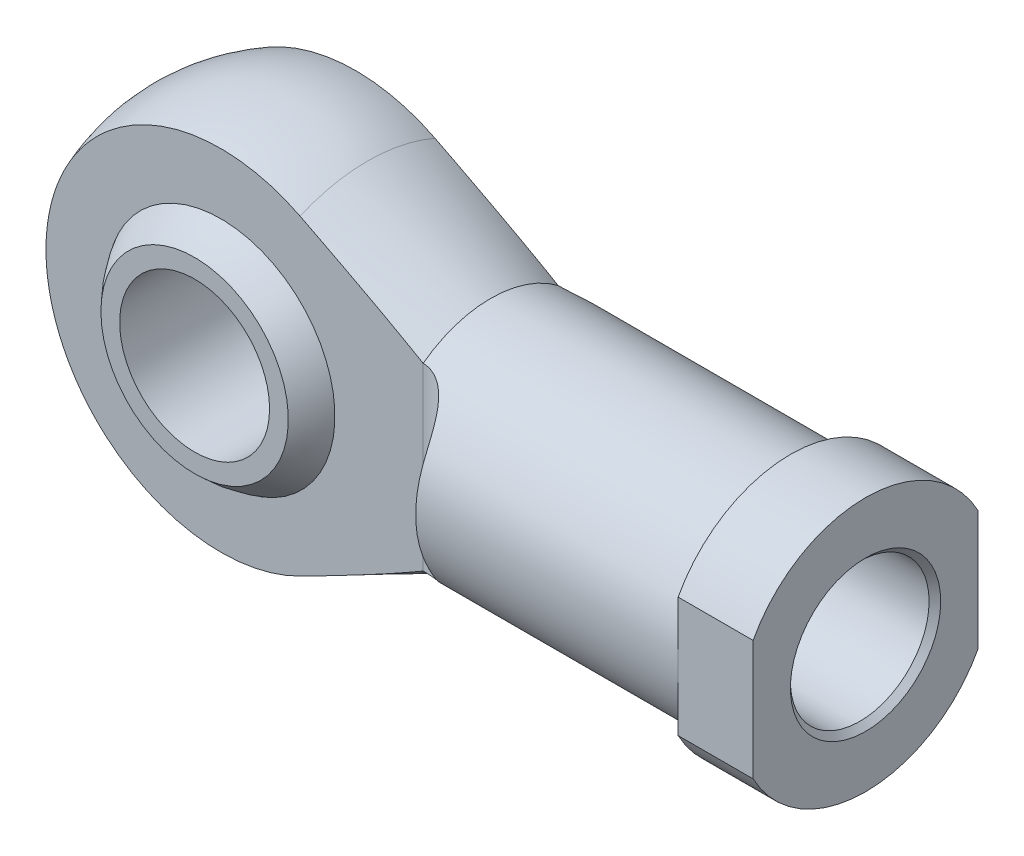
ISO-10303-21;
HEADER;
FILE_DESCRIPTION(('STEP AP214'),'2;1');
FILE_NAME('part.step','',(''),(''),'','','');
FILE_SCHEMA(('AUTOMOTIVE_DESIGN { 1 0 10303 214 1 1 1 1 }'));
ENDSEC;
DATA;
#1=APPLICATION_CONTEXT('core data for automotive mechanical design processes');
#2=APPLICATION_PROTOCOL_DEFINITION('international standard','automotive_design',2000,#1);
#3=PRODUCT_CONTEXT('',#1,'mechanical');
#4=PRODUCT('Part','Part','',(#3));
#5=PRODUCT_RELATED_PRODUCT_CATEGORY('part','',(#4));
#6=PRODUCT_DEFINITION_FORMATION('','',#4);
#7=PRODUCT_DEFINITION_CONTEXT('part definition',#1,'design');
#8=PRODUCT_DEFINITION('design','',#6,#7);
#9=PRODUCT_DEFINITION_SHAPE('','',#8);
#10=(LENGTH_UNIT() NAMED_UNIT(*) SI_UNIT(.MILLI.,.METRE.));
#11=(NAMED_UNIT(*) PLANE_ANGLE_UNIT() SI_UNIT($,.RADIAN.));
#12=(NAMED_UNIT(*) SI_UNIT($,.STERADIAN.) SOLID_ANGLE_UNIT());
#13=UNCERTAINTY_MEASURE_WITH_UNIT(LENGTH_MEASURE(1.E-05),#10,'distance_accuracy_value','');
#14=(GEOMETRIC_REPRESENTATION_CONTEXT(3) GLOBAL_UNCERTAINTY_ASSIGNED_CONTEXT((#13)) GLOBAL_UNIT_ASSIGNED_CONTEXT((#10,
#11,#12)) REPRESENTATION_CONTEXT('',''));
#15=CARTESIAN_POINT('',(0.,0.,0.));
#16=DIRECTION('',(0.,0.,1.));
#17=DIRECTION('',(1.,0.,0.));
#18=AXIS2_PLACEMENT_3D('',#15,#16,#17);
#19=CARTESIAN_POINT('',(-89.5,0.,-12.5));
#20=DIRECTION('',(0.,0.,-1.));
#21=DIRECTION('',(-1.,0.,0.));
#22=AXIS2_PLACEMENT_3D('',#19,#20,#21);
#23=PLANE('',#22);
#24=CARTESIAN_POINT('',(-77.,0.,-12.5));
#25=DIRECTION('',(0.,0.,-1.));
#26=DIRECTION('',(-1.,0.,0.));
#27=AXIS2_PLACEMENT_3D('',#24,#25,#26);
#28=CIRCLE('',#27,9.99999999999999);
#29=CARTESIAN_POINT('',(-87.,0.,-12.5));
#30=VERTEX_POINT('',#29);
#31=EDGE_CURVE('E61',#30,#30,#28,.T.);
#32=ORIENTED_EDGE('',*,*,#31,.F.);
#33=EDGE_LOOP('',(#32));
#34=FACE_BOUND('',#33,.T.);
#35=CARTESIAN_POINT('',(-77.,0.,-12.5));
#36=DIRECTION('',(0.,0.,-1.));
#37=DIRECTION('',(-1.,0.,0.));
#38=AXIS2_PLACEMENT_3D('',#35,#36,#37);
#39=CIRCLE('',#38,12.5);
#40=CARTESIAN_POINT('',(-89.5,0.,-12.5));
#41=VERTEX_POINT('',#40);
#42=EDGE_CURVE('E12',#41,#41,#39,.T.);
#43=ORIENTED_EDGE('',*,*,#42,.T.);
#44=EDGE_LOOP('',(#43));
#45=FACE_BOUND('',#44,.T.);
#46=ADVANCED_FACE('F50',(#34,#45),#23,.T.);
#47=CARTESIAN_POINT('',(-77.,0.,0.));
#48=DIRECTION('',(0.,0.,-1.));
#49=DIRECTION('',(-1.,0.,0.));
#50=AXIS2_PLACEMENT_3D('',#47,#48,#49);
#51=SPHERICAL_SURFACE('',#50,17.6776695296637);
#52=CARTESIAN_POINT('',(-77.,0.,12.5));
#53=DIRECTION('',(0.,0.,-1.));
#54=DIRECTION('',(-1.,0.,0.));
#55=AXIS2_PLACEMENT_3D('',#52,#53,#54);
#56=CIRCLE('',#55,12.5);
#57=CARTESIAN_POINT('',(-89.5,0.,12.5));
#58=VERTEX_POINT('',#57);
#59=EDGE_CURVE('E57',#58,#58,#56,.T.);
#60=CARTESIAN_POINT('',(-89.5,0.,12.5));
#61=CARTESIAN_POINT('',(-89.7045353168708,0.,12.2954733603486));
#62=CARTESIAN_POINT('',(-89.9040418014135,0.,12.0859186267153));
#63=CARTESIAN_POINT('',(-90.2925364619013,0.,11.6572759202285));
#64=CARTESIAN_POINT('',(-90.4815246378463,0.,11.438187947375));
#65=CARTESIAN_POINT('',(-90.8485220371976,0.,10.9910017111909));
#66=CARTESIAN_POINT('',(-91.0265312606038,0.,10.7629034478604));
#67=CARTESIAN_POINT('',(-91.3711433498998,0.,10.2982474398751));
#68=CARTESIAN_POINT('',(-91.5377462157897,0.,10.0616896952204));
#69=CARTESIAN_POINT('',(-91.8591438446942,0.,9.58068426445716));
#70=CARTESIAN_POINT('',(-92.0139386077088,0.,9.33623657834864));
#71=CARTESIAN_POINT('',(-92.3113472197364,0.,8.84004025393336));
#72=CARTESIAN_POINT('',(-92.4539610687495,0.,8.5882916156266));
#73=CARTESIAN_POINT('',(-92.7266642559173,0.,8.07809984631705));
#74=CARTESIAN_POINT('',(-92.856753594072,0.,7.81965671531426));
#75=CARTESIAN_POINT('',(-93.1040943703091,0.,7.29669857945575));
#76=CARTESIAN_POINT('',(-93.2213458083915,0.,7.03218357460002));
#77=CARTESIAN_POINT('',(-93.4427283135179,0.,6.4977189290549));
#78=CARTESIAN_POINT('',(-93.5468593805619,0.,6.2277692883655));
#79=CARTESIAN_POINT('',(-93.7417502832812,0.,5.68308570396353));
#80=CARTESIAN_POINT('',(-93.8325101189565,0.,5.40835176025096));
#81=CARTESIAN_POINT('',(-94.0004399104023,0.,4.85476142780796));
#82=CARTESIAN_POINT('',(-94.0776098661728,0.,4.57590503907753));
#83=CARTESIAN_POINT('',(-94.2181739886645,0.,4.01474160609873));
#84=CARTESIAN_POINT('',(-94.2815681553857,0.,3.73243456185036));
#85=CARTESIAN_POINT('',(-94.394427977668,0.,3.16504992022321));
#86=CARTESIAN_POINT('',(-94.4438936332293,0.,2.87997232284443));
#87=CARTESIAN_POINT('',(-94.5287772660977,0.,2.30773335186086));
#88=CARTESIAN_POINT('',(-94.5641952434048,0.,2.02057197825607));
#89=CARTESIAN_POINT('',(-94.6208981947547,0.,1.44485725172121));
#90=CARTESIAN_POINT('',(-94.6421831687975,0.,1.15630389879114));
#91=CARTESIAN_POINT('',(-94.670568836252,0.,0.578500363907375));
#92=CARTESIAN_POINT('',(-94.6776695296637,0.,0.289250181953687));
#93=CARTESIAN_POINT('',(-94.6776695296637,0.,-0.28925018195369));
#94=CARTESIAN_POINT('',(-94.670568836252,0.,-0.578500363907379));
#95=CARTESIAN_POINT('',(-94.6421831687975,0.,-1.15630389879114));
#96=CARTESIAN_POINT('',(-94.6208981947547,0.,-1.44485725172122));
#97=CARTESIAN_POINT('',(-94.5641952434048,0.,-2.02057197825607));
#98=CARTESIAN_POINT('',(-94.5287772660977,0.,-2.30773335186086));
#99=CARTESIAN_POINT('',(-94.4438936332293,0.,-2.87997232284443));
#100=CARTESIAN_POINT('',(-94.394427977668,0.,-3.16504992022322));
#101=CARTESIAN_POINT('',(-94.2815681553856,0.,-3.73243456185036));
#102=CARTESIAN_POINT('',(-94.2181739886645,0.,-4.01474160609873));
#103=CARTESIAN_POINT('',(-94.0776098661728,0.,-4.57590503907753));
#104=CARTESIAN_POINT('',(-94.0004399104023,0.,-4.85476142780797));
#105=CARTESIAN_POINT('',(-93.8325101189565,0.,-5.40835176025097));
#106=CARTESIAN_POINT('',(-93.7417502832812,0.,-5.68308570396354));
#107=CARTESIAN_POINT('',(-93.5468593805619,0.,-6.2277692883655));
#108=CARTESIAN_POINT('',(-93.4427283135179,0.,-6.4977189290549));
#109=CARTESIAN_POINT('',(-93.2213458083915,0.,-7.03218357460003));
#110=CARTESIAN_POINT('',(-93.1040943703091,0.,-7.29669857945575));
#111=CARTESIAN_POINT('',(-92.8567535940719,0.,-7.81965671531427));
#112=CARTESIAN_POINT('',(-92.7266642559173,0.,-8.07809984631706));
#113=CARTESIAN_POINT('',(-92.4539610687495,0.,-8.58829161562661));
#114=CARTESIAN_POINT('',(-92.3113472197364,0.,-8.84004025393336));
#115=CARTESIAN_POINT('',(-92.0139386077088,0.,-9.33623657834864));
#116=CARTESIAN_POINT('',(-91.8591438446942,0.,-9.58068426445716));
#117=CARTESIAN_POINT('',(-91.5377462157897,0.,-10.0616896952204));
#118=CARTESIAN_POINT('',(-91.3711433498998,0.,-10.2982474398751));
#119=CARTESIAN_POINT('',(-91.0265312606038,0.,-10.7629034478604));
#120=CARTESIAN_POINT('',(-90.8485220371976,0.,-10.9910017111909));
#121=CARTESIAN_POINT('',(-90.4815246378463,0.,-11.438187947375));
#122=CARTESIAN_POINT('',(-90.2925364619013,0.,-11.6572759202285));
#123=CARTESIAN_POINT('',(-89.9040418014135,0.,-12.0859186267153));
#124=CARTESIAN_POINT('',(-89.7045353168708,0.,-12.2954733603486));
#125=CARTESIAN_POINT('',(-89.5,0.,-12.5));
#126=B_SPLINE_CURVE_WITH_KNOTS('',3,(#60,#61,#62,#63,#64,#65,#66,#67,#68,#69,#70,#71,#72,#73,
#74,#75,#76,#77,#78,#79,#80,#81,#82,#83,#84,#85,#86,#87,#88,#89,#90,#91,#92,#93,#94,#95,#96,#97,
#98,#99,#100,#101,#102,#103,#104,#105,#106,#107,#108,#109,#110,#111,#112,#113,#114,#115,#116,
#117,#118,#119,#120,#121,#122,#123,#124,#125),.UNSPECIFIED.,.F.,.F.,(4,2,2,2,2,2,2,2,2,2,2,2,2,
2,2,2,2,2,2,2,2,2,2,2,2,2,2,2,2,2,2,2,4),(0.,0.867663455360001,1.73532691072,2.60299036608,
3.47065382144,4.3383172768,5.20598073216,6.07364418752,6.94130764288,7.80897109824,8.6766345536,
9.54429800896,10.41196146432,11.27962491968,12.14728837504,13.0149518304,13.88261528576,
14.75027874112,15.61794219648,16.48560565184,17.3532691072,18.22093256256,19.08859601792,
19.95625947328,20.82392292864,21.691586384,22.55924983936,23.42691329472,24.29457675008,
25.16224020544,26.0299036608,26.89756711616,27.76523057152),.UNSPECIFIED.);
#127=EDGE_CURVE('BSEAM75',#58,#41,#126,.T.);
#128=ORIENTED_EDGE('',*,*,#59,.T.);
#129=ORIENTED_EDGE('',*,*,#42,.F.);
#130=ORIENTED_EDGE('',*,*,#127,.T.);
#131=ORIENTED_EDGE('',*,*,#127,.F.);
#132=EDGE_LOOP('',(#128,#130,#129,#131));
#133=FACE_BOUND('',#132,.T.);
#134=ADVANCED_FACE('F75',(#133),#51,.T.);
#135=CARTESIAN_POINT('',(-89.5,0.,12.5));
#136=DIRECTION('',(0.,0.,1.));
#137=DIRECTION('',(1.,0.,0.));
#138=AXIS2_PLACEMENT_3D('',#135,#136,#137);
#139=PLANE('',#138);
#140=CARTESIAN_POINT('',(-77.,0.,12.5));
#141=DIRECTION('',(0.,0.,1.));
#142=DIRECTION('',(1.,0.,0.));
#143=AXIS2_PLACEMENT_3D('',#140,#141,#142);
#144=CIRCLE('',#143,9.99999999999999);
#145=CARTESIAN_POINT('',(-67.,0.,12.5));
#146=VERTEX_POINT('',#145);
#147=EDGE_CURVE('E53',#146,#146,#144,.T.);
#148=ORIENTED_EDGE('',*,*,#147,.F.);
#149=EDGE_LOOP('',(#148));
#150=FACE_BOUND('',#149,.T.);
#151=ORIENTED_EDGE('',*,*,#59,.F.);
#152=EDGE_LOOP('',(#151));
#153=FACE_BOUND('',#152,.T.);
#154=ADVANCED_FACE('F72',(#150,#153),#139,.T.);
#155=CARTESIAN_POINT('',(-77.,0.,-25.));
#156=DIRECTION('',(0.,0.,1.));
#157=DIRECTION('',(1.,0.,0.));
#158=AXIS2_PLACEMENT_3D('',#155,#156,#157);
#159=CYLINDRICAL_SURFACE('',#158,9.99999999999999);
#160=ORIENTED_EDGE('',*,*,#31,.T.);
#161=EDGE_LOOP('',(#160));
#162=FACE_BOUND('',#161,.T.);
#163=ORIENTED_EDGE('',*,*,#147,.T.);
#164=EDGE_LOOP('',(#163));
#165=FACE_BOUND('',#164,.T.);
#166=ADVANCED_FACE('F70',(#162,#165),#159,.F.);
#167=CLOSED_SHELL('',(#46,#134,#154,#166));
#168=MANIFOLD_SOLID_BREP('B2',#167);
#169=CARTESIAN_POINT('',(0.,0.,0.));
#170=DIRECTION('',(1.,0.,0.));
#171=DIRECTION('',(0.,1.,0.));
#172=AXIS2_PLACEMENT_3D('',#169,#170,#171);
#173=CYLINDRICAL_SURFACE('',#172,17.);
#174=CARTESIAN_POINT('',(0.,0.,0.));
#175=DIRECTION('',(1.,0.,0.));
#176=DIRECTION('',(0.,1.,0.));
#177=AXIS2_PLACEMENT_3D('',#174,#175,#176);
#178=CIRCLE('',#177,17.);
#179=CARTESIAN_POINT('',(0.,-8.,15.));
#180=VERTEX_POINT('',#179);
#181=CARTESIAN_POINT('',(0.,-8.00000000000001,-15.));
#182=VERTEX_POINT('',#181);
#183=EDGE_CURVE('E346',#180,#182,#178,.T.);
#184=ORIENTED_EDGE('',*,*,#183,.F.);
#185=DIRECTION('',(1.,0.,0.));
#186=VECTOR('',#185,1.);
#187=CARTESIAN_POINT('',(0.,-8.,15.));
#188=LINE('',#187,#186);
#189=CARTESIAN_POINT('',(-10.,-8.,15.));
#190=VERTEX_POINT('',#189);
#191=EDGE_CURVE('E134',#180,#190,#188,.F.);
#192=ORIENTED_EDGE('',*,*,#191,.T.);
#193=CARTESIAN_POINT('',(-10.,0.,0.));
#194=DIRECTION('',(1.,0.,0.));
#195=DIRECTION('',(0.,1.,0.));
#196=AXIS2_PLACEMENT_3D('',#193,#194,#195);
#197=CIRCLE('',#196,17.);
#198=CARTESIAN_POINT('',(-10.,-8.00000000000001,-15.));
#199=VERTEX_POINT('',#198);
#200=EDGE_CURVE('E371',#190,#199,#197,.T.);
#201=ORIENTED_EDGE('',*,*,#200,.T.);
#202=DIRECTION('',(1.,0.,0.));
#203=VECTOR('',#202,1.);
#204=CARTESIAN_POINT('',(0.,-8.,-15.));
#205=LINE('',#204,#203);
#206=EDGE_CURVE('E211',#199,#182,#205,.T.);
#207=ORIENTED_EDGE('',*,*,#206,.T.);
#208=EDGE_LOOP('',(#184,#192,#201,#207));
#209=FACE_BOUND('',#208,.T.);
#210=ADVANCED_FACE('F112',(#209),#173,.T.);
#211=CARTESIAN_POINT('',(-10.,8.00000000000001,-15.));
#212=VERTEX_POINT('',#211);
#213=CARTESIAN_POINT('',(-10.,7.99999999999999,15.));
#214=VERTEX_POINT('',#213);
#215=EDGE_CURVE('E357',#212,#214,#197,.T.);
#216=ORIENTED_EDGE('',*,*,#215,.T.);
#217=DIRECTION('',(1.,0.,0.));
#218=VECTOR('',#217,1.);
#219=CARTESIAN_POINT('',(0.,7.99999999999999,15.));
#220=LINE('',#219,#218);
#221=CARTESIAN_POINT('',(0.,7.99999999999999,15.));
#222=VERTEX_POINT('',#221);
#223=EDGE_CURVE('E225',#214,#222,#220,.T.);
#224=ORIENTED_EDGE('',*,*,#223,.T.);
#225=CARTESIAN_POINT('',(0.,8.00000000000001,-15.));
#226=VERTEX_POINT('',#225);
#227=EDGE_CURVE('E293',#226,#222,#178,.T.);
#228=ORIENTED_EDGE('',*,*,#227,.F.);
#229=DIRECTION('',(1.,0.,0.));
#230=VECTOR('',#229,1.);
#231=CARTESIAN_POINT('',(0.,8.00000000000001,-15.));
#232=LINE('',#231,#230);
#233=EDGE_CURVE('E126',#226,#212,#232,.F.);
#234=ORIENTED_EDGE('',*,*,#233,.T.);
#235=EDGE_LOOP('',(#216,#224,#228,#234));
#236=FACE_BOUND('',#235,.T.);
#237=ADVANCED_FACE('F338',(#236),#173,.T.);
#238=CARTESIAN_POINT('',(-10.,17.,0.));
#239=DIRECTION('',(-1.,0.,0.));
#240=DIRECTION('',(0.,-1.,0.));
#241=AXIS2_PLACEMENT_3D('',#238,#239,#240);
#242=PLANE('',#241);
#243=ORIENTED_EDGE('',*,*,#200,.F.);
#244=DIRECTION('',(0.,1.,0.));
#245=VECTOR('',#244,1.);
#246=CARTESIAN_POINT('',(-10.,17.,15.));
#247=LINE('',#246,#245);
#248=CARTESIAN_POINT('',(-10.,0.,15.));
#249=VERTEX_POINT('',#248);
#250=EDGE_CURVE('E226',#190,#249,#247,.T.);
#251=ORIENTED_EDGE('',*,*,#250,.T.);
#252=CARTESIAN_POINT('',(-10.,0.,0.));
#253=DIRECTION('',(1.,0.,0.));
#254=DIRECTION('',(0.,1.,0.));
#255=AXIS2_PLACEMENT_3D('',#252,#253,#254);
#256=CIRCLE('',#255,15.);
#257=CARTESIAN_POINT('',(-10.,0.,-15.));
#258=VERTEX_POINT('',#257);
#259=EDGE_CURVE('E367',#249,#258,#256,.T.);
#260=ORIENTED_EDGE('',*,*,#259,.T.);
#261=DIRECTION('',(0.,-1.,0.));
#262=VECTOR('',#261,1.);
#263=CARTESIAN_POINT('',(-10.,17.,-15.));
#264=LINE('',#263,#262);
#265=EDGE_CURVE('E207',#258,#199,#264,.T.);
#266=ORIENTED_EDGE('',*,*,#265,.T.);
#267=EDGE_LOOP('',(#243,#251,#260,#266));
#268=FACE_BOUND('',#267,.T.);
#269=ADVANCED_FACE('F300',(#268),#242,.T.);
#270=EDGE_CURVE('E363',#258,#249,#256,.T.);
#271=ORIENTED_EDGE('',*,*,#270,.T.);
#272=EDGE_CURVE('E222',#249,#214,#247,.T.);
#273=ORIENTED_EDGE('',*,*,#272,.T.);
#274=ORIENTED_EDGE('',*,*,#215,.F.);
#275=EDGE_CURVE('E213',#212,#258,#264,.T.);
#276=ORIENTED_EDGE('',*,*,#275,.T.);
#277=EDGE_LOOP('',(#271,#273,#274,#276));
#278=FACE_BOUND('',#277,.T.);
#279=ADVANCED_FACE('F325',(#278),#242,.T.);
#280=CARTESIAN_POINT('',(0.,0.,0.));
#281=DIRECTION('',(1.,0.,0.));
#282=DIRECTION('',(0.,1.,0.));
#283=AXIS2_PLACEMENT_3D('',#280,#281,#282);
#284=PLANE('',#283);
#285=CARTESIAN_POINT('',(0.,0.,0.));
#286=DIRECTION('',(1.,0.,0.));
#287=DIRECTION('',(0.,0.,-1.));
#288=AXIS2_PLACEMENT_3D('',#285,#286,#287);
#289=CIRCLE('',#288,10.025);
#290=CARTESIAN_POINT('',(0.,0.,-10.025));
#291=VERTEX_POINT('',#290);
#292=EDGE_CURVE('E215',#291,#291,#289,.T.);
#293=ORIENTED_EDGE('',*,*,#292,.F.);
#294=EDGE_LOOP('',(#293));
#295=FACE_BOUND('',#294,.T.);
#296=ORIENTED_EDGE('',*,*,#227,.T.);
#297=DIRECTION('',(0.,-1.,0.));
#298=VECTOR('',#297,1.);
#299=CARTESIAN_POINT('',(0.,0.,15.));
#300=LINE('',#299,#298);
#301=EDGE_CURVE('E48',#222,#180,#300,.T.);
#302=ORIENTED_EDGE('',*,*,#301,.T.);
#303=ORIENTED_EDGE('',*,*,#183,.T.);
#304=DIRECTION('',(0.,1.,0.));
#305=VECTOR('',#304,1.);
#306=CARTESIAN_POINT('',(0.,0.,-15.));
#307=LINE('',#306,#305);
#308=EDGE_CURVE('E119',#182,#226,#307,.T.);
#309=ORIENTED_EDGE('',*,*,#308,.T.);
#310=EDGE_LOOP('',(#296,#302,#303,#309));
#311=FACE_BOUND('',#310,.T.);
#312=ADVANCED_FACE('F323',(#295,#311),#284,.T.);
#313=CARTESIAN_POINT('',(-50.0125642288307,0.,0.));
#314=DIRECTION('',(-1.,0.,0.));
#315=DIRECTION('',(0.,-1.,0.));
#316=AXIS2_PLACEMENT_3D('',#313,#314,#315);
#317=CONICAL_SURFACE('',#316,15.,0.436332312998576);
#318=CARTESIAN_POINT('',(-95.3542823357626,35.0047169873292,-9.));
#319=CARTESIAN_POINT('',(-94.4047615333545,34.54754518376,-9.));
#320=CARTESIAN_POINT('',(-93.4554555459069,34.0899273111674,-9.));
#321=CARTESIAN_POINT('',(-91.5573336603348,33.1736749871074,-9.));
#322=CARTESIAN_POINT('',(-90.6085177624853,32.71504053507,-9.));
#323=CARTESIAN_POINT('',(-87.7628290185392,31.337393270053,-9.));
#324=CARTESIAN_POINT('',(-85.8667836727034,30.4166695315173,-9.));
#325=CARTESIAN_POINT('',(-82.074917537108,28.5679989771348,-9.));
#326=CARTESIAN_POINT('',(-80.1791008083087,27.6400438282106,-9.));
#327=CARTESIAN_POINT('',(-76.391409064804,25.7762463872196,-9.));
#328=CARTESIAN_POINT('',(-74.4995339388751,24.8404043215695,-9.));
#329=CARTESIAN_POINT('',(-71.6582752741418,23.4246557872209,-9.));
#330=CARTESIAN_POINT('',(-70.7068533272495,22.9488403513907,-9.));
#331=CARTESIAN_POINT('',(-68.8056926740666,21.9938585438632,-9.));
#332=CARTESIAN_POINT('',(-67.8559539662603,21.514692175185,-9.));
#333=CARTESIAN_POINT('',(-65.9584413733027,20.5522696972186,-9.));
#334=CARTESIAN_POINT('',(-65.0106676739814,20.0690132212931,-9.));
#335=CARTESIAN_POINT('',(-63.117669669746,19.0975380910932,-9.));
#336=CARTESIAN_POINT('',(-62.172445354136,18.6093194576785,-9.));
#337=CARTESIAN_POINT('',(-60.2858300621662,17.6270179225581,-9.));
#338=CARTESIAN_POINT('',(-59.3444369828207,17.1329390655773,-9.));
#339=CARTESIAN_POINT('',(-57.4658171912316,16.1369331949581,-9.));
#340=CARTESIAN_POINT('',(-56.528590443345,15.6350062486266,-9.));
#341=CARTESIAN_POINT('',(-54.6597808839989,14.6210283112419,-9.));
#342=CARTESIAN_POINT('',(-53.7281972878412,14.1089787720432,-9.));
#343=CARTESIAN_POINT('',(-52.336584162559,13.3306422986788,-9.));
#344=CARTESIAN_POINT('',(-51.8736815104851,13.0694910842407,-9.));
#345=CARTESIAN_POINT('',(-50.9501791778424,12.54315080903,-9.));
#346=CARTESIAN_POINT('',(-50.4895794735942,12.2779617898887,-9.));
#347=CARTESIAN_POINT('',(-49.7794993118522,11.8641929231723,-9.));
#348=CARTESIAN_POINT('',(-49.529040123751,11.717291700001,-9.));
#349=CARTESIAN_POINT('',(-49.029052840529,11.4219084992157,-9.));
#350=CARTESIAN_POINT('',(-48.7795247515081,11.2734265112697,-9.));
#351=CARTESIAN_POINT('',(-48.2814969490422,10.9747036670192,-9.));
#352=CARTESIAN_POINT('',(-48.0329973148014,10.8244626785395,-9.));
#353=CARTESIAN_POINT('',(-47.5371858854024,10.5220354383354,-9.));
#354=CARTESIAN_POINT('',(-47.2898740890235,10.3698491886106,-9.));
#355=CARTESIAN_POINT('',(-46.5497901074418,9.90994382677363,-9.));
#356=CARTESIAN_POINT('',(-46.0590275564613,9.59897262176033,-9.));
#357=CARTESIAN_POINT('',(-45.0846601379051,8.96612521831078,-9.));
#358=CARTESIAN_POINT('',(-44.6010542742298,8.64425055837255,-9.));
#359=CARTESIAN_POINT('',(-43.6813072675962,8.0122665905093,-9.));
#360=CARTESIAN_POINT('',(-43.2444323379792,7.70323358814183,-9.));
#361=CARTESIAN_POINT('',(-42.5976453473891,7.22780306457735,-9.));
#362=CARTESIAN_POINT('',(-42.3834040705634,7.06729332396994,-9.));
#363=CARTESIAN_POINT('',(-41.9584174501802,6.74171826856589,-9.));
#364=CARTESIAN_POINT('',(-41.7476719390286,6.57665317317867,-9.));
#365=CARTESIAN_POINT('',(-41.3297847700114,6.24071632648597,-9.));
#366=CARTESIAN_POINT('',(-41.122656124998,6.0698283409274,-9.));
#367=CARTESIAN_POINT('',(-40.7137086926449,5.72183267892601,-9.));
#368=CARTESIAN_POINT('',(-40.5118893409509,5.54472566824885,-9.));
#369=CARTESIAN_POINT('',(-40.115111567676,5.18333388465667,-9.));
#370=CARTESIAN_POINT('',(-39.920146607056,4.99905632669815,-9.));
#371=CARTESIAN_POINT('',(-39.5388070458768,4.62182577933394,-9.));
#372=CARTESIAN_POINT('',(-39.3524309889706,4.42887427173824,-9.));
#373=CARTESIAN_POINT('',(-38.987574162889,4.02896114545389,-9.));
#374=CARTESIAN_POINT('',(-38.8093032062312,3.82180639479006,-9.));
#375=CARTESIAN_POINT('',(-38.4683868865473,3.39460757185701,-9.));
#376=CARTESIAN_POINT('',(-38.3057524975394,3.17455461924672,-9.));
#377=CARTESIAN_POINT('',(-38.0037301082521,2.72201583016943,-9.));
#378=CARTESIAN_POINT('',(-37.8641258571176,2.48967637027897,-9.));
#379=CARTESIAN_POINT('',(-37.6145016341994,2.0095126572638,-9.));
#380=CARTESIAN_POINT('',(-37.5044367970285,1.76171259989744,-9.));
#381=CARTESIAN_POINT('',(-37.3709141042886,1.38471848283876,-9.));
#382=CARTESIAN_POINT('',(-37.3321855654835,1.26087148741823,-9.));
#383=CARTESIAN_POINT('',(-37.2649670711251,1.01047611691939,-9.));
#384=CARTESIAN_POINT('',(-37.2364704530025,0.88392955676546,-9.));
#385=CARTESIAN_POINT('',(-37.1906627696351,0.628863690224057,-9.));
#386=CARTESIAN_POINT('',(-37.1733473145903,0.500345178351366,-9.));
#387=CARTESIAN_POINT('',(-37.1505338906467,0.242252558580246,-9.));
#388=CARTESIAN_POINT('',(-37.1450358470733,0.112678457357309,-9.));
#389=CARTESIAN_POINT('',(-37.1460783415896,-0.146658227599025,-9.));
#390=CARTESIAN_POINT('',(-37.1526409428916,-0.27642072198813,-9.));
#391=CARTESIAN_POINT('',(-37.1775854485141,-0.534793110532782,-9.));
#392=CARTESIAN_POINT('',(-37.1959674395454,-0.663402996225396,-9.));
#393=CARTESIAN_POINT('',(-37.2438897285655,-0.918661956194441,-9.));
#394=CARTESIAN_POINT('',(-37.2734428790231,-1.04530859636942,-9.));
#395=CARTESIAN_POINT('',(-37.3427225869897,-1.29580211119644,-9.));
#396=CARTESIAN_POINT('',(-37.382452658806,-1.41964800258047,-9.));
#397=CARTESIAN_POINT('',(-37.4888682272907,-1.71351615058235,-9.));
#398=CARTESIAN_POINT('',(-37.5599559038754,-1.88194633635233,-9.));
#399=CARTESIAN_POINT('',(-37.7168200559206,-2.21180681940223,-9.));
#400=CARTESIAN_POINT('',(-37.8026040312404,-2.37323348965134,-9.));
#401=CARTESIAN_POINT('',(-37.986234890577,-2.68951094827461,-9.));
#402=CARTESIAN_POINT('',(-38.0841091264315,-2.84434571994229,-9.));
#403=CARTESIAN_POINT('',(-38.2894063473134,-3.14744557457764,-9.));
#404=CARTESIAN_POINT('',(-38.3968274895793,-3.29571191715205,-9.));
#405=CARTESIAN_POINT('',(-38.6668712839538,-3.64833212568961,-9.));
#406=CARTESIAN_POINT('',(-38.8334878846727,-3.84961928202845,-9.));
#407=CARTESIAN_POINT('',(-39.1784507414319,-4.24194559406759,-9.));
#408=CARTESIAN_POINT('',(-39.3568035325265,-4.43297893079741,-9.));
#409=CARTESIAN_POINT('',(-39.7227617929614,-4.80667440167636,-9.));
#410=CARTESIAN_POINT('',(-39.9103852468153,-4.9893188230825,-9.));
#411=CARTESIAN_POINT('',(-40.2925156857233,-5.347140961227,-9.));
#412=CARTESIAN_POINT('',(-40.4870213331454,-5.52232011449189,-9.));
#413=CARTESIAN_POINT('',(-40.8829150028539,-5.86759167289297,-9.));
#414=CARTESIAN_POINT('',(-41.0843421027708,-6.03763909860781,-9.));
#415=CARTESIAN_POINT('',(-41.4916795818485,-6.37227551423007,-9.));
#416=CARTESIAN_POINT('',(-41.697590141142,-6.53686428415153,-9.));
#417=CARTESIAN_POINT('',(-42.1128059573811,-6.86113195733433,-9.));
#418=CARTESIAN_POINT('',(-42.3221065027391,-7.02081690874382,-9.));
#419=CARTESIAN_POINT('',(-42.7437321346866,-7.33611693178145,-9.));
#420=CARTESIAN_POINT('',(-42.9560571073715,-7.49173215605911,-9.));
#421=CARTESIAN_POINT('',(-43.410444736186,-7.8190030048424,-9.));
#422=CARTESIAN_POINT('',(-43.6528524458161,-7.99017900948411,-9.));
#423=CARTESIAN_POINT('',(-44.1403721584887,-8.32864004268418,-9.));
#424=CARTESIAN_POINT('',(-44.3854842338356,-8.49592496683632,-9.));
#425=CARTESIAN_POINT('',(-45.1242780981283,-8.99275665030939,-9.));
#426=CARTESIAN_POINT('',(-45.6213650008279,-9.31724286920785,-9.));
#427=CARTESIAN_POINT('',(-46.6223892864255,-9.9559316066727,-9.));
#428=CARTESIAN_POINT('',(-47.1263297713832,-10.2701292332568,-9.));
#429=CARTESIAN_POINT('',(-48.1392837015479,-10.8902543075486,-9.));
#430=CARTESIAN_POINT('',(-48.6482972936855,-11.1961815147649,-9.));
#431=CARTESIAN_POINT('',(-49.671266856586,-11.8019372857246,-9.));
#432=CARTESIAN_POINT('',(-50.1852305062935,-12.1017528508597,-9.));
#433=CARTESIAN_POINT('',(-51.2163339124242,-12.6958784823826,-9.));
#434=CARTESIAN_POINT('',(-51.7334737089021,-12.9901884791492,-9.));
#435=CARTESIAN_POINT('',(-52.7701814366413,-13.5741404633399,-9.));
#436=CARTESIAN_POINT('',(-53.2897486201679,-13.8637837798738,-9.));
#437=CARTESIAN_POINT('',(-54.3310177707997,-14.4392078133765,-9.));
#438=CARTESIAN_POINT('',(-54.8527197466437,-14.7249885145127,-9.));
#439=CARTESIAN_POINT('',(-56.4176818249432,-15.5759004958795,-9.));
#440=CARTESIAN_POINT('',(-57.46358863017,-16.1361644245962,-9.));
#441=CARTESIAN_POINT('',(-59.5605721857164,-17.2470733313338,-9.));
#442=CARTESIAN_POINT('',(-60.6116492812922,-17.797717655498,-9.));
#443=CARTESIAN_POINT('',(-62.7165446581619,-18.8910064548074,-9.));
#444=CARTESIAN_POINT('',(-63.7703588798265,-19.433658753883,-9.));
#445=CARTESIAN_POINT('',(-65.880962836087,-20.5131469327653,-9.));
#446=CARTESIAN_POINT('',(-66.9377525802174,-21.0499827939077,-9.));
#447=CARTESIAN_POINT('',(-69.129706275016,-22.1574022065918,-9.));
#448=CARTESIAN_POINT('',(-70.2650453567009,-22.7276388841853,-9.));
#449=CARTESIAN_POINT('',(-72.5378758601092,-23.8638193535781,-9.));
#450=CARTESIAN_POINT('',(-73.6753672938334,-24.4297631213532,-9.));
#451=CARTESIAN_POINT('',(-75.9524867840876,-25.5583434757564,-9.));
#452=CARTESIAN_POINT('',(-77.0921154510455,-26.1209788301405,-9.));
#453=CARTESIAN_POINT('',(-79.372800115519,-27.2433488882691,-9.));
#454=CARTESIAN_POINT('',(-80.5138561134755,-27.8030835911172,-9.));
#455=CARTESIAN_POINT('',(-82.7953669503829,-28.9192505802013,-9.));
#456=CARTESIAN_POINT('',(-83.9358199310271,-29.4756866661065,-9.));
#457=CARTESIAN_POINT('',(-86.2177232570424,-30.5865117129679,-9.));
#458=CARTESIAN_POINT('',(-87.3591736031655,-31.140900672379,-9.));
#459=CARTESIAN_POINT('',(-89.6424856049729,-32.2477222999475,-9.));
#460=CARTESIAN_POINT('',(-90.7843469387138,-32.8001556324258,-9.));
#461=CARTESIAN_POINT('',(-93.0687973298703,-33.9035110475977,-9.));
#462=CARTESIAN_POINT('',(-94.2113863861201,-34.4544331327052,-9.));
#463=CARTESIAN_POINT('',(-95.3542823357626,-35.0047169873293,-9.));
#464=B_SPLINE_CURVE_WITH_KNOTS('',3,(#318,#319,#320,#321,#322,#323,#324,#325,#326,#327,#328,
#329,#330,#331,#332,#333,#334,#335,#336,#337,#338,#339,#340,#341,#342,#343,#344,#345,#346,#347,
#348,#349,#350,#351,#352,#353,#354,#355,#356,#357,#358,#359,#360,#361,#362,#363,#364,#365,#366,
#367,#368,#369,#370,#371,#372,#373,#374,#375,#376,#377,#378,#379,#380,#381,#382,#383,#384,#385,
#386,#387,#388,#389,#390,#391,#392,#393,#394,#395,#396,#397,#398,#399,#400,#401,#402,#403,#404,
#405,#406,#407,#408,#409,#410,#411,#412,#413,#414,#415,#416,#417,#418,#419,#420,#421,#422,#423,
#424,#425,#426,#427,#428,#429,#430,#431,#432,#433,#434,#435,#436,#437,#438,#439,#440,#441,#442,
#443,#444,#445,#446,#447,#448,#449,#450,#451,#452,#453,#454,#455,#456,#457,#458,#459,#460,#461,
#462,#463),.UNSPECIFIED.,.F.,.F.,(4,2,2,2,2,2,2,2,2,2,2,2,2,2,2,2,2,2,2,2,2,2,2,2,2,2,2,2,2,2,2,
2,2,2,2,2,2,2,2,2,2,2,2,2,2,2,2,2,2,2,2,2,2,2,2,2,2,2,2,2,2,2,2,2,2,2,2,2,2,2,2,2,4),(0.,
3.16154401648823,6.32308980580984,12.6464096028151,18.9786166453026,25.3106425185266,
28.5019437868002,31.6932421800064,34.8848297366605,38.076403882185,41.2658904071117,
44.4553495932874,47.6443545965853,49.2388015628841,50.8332321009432,51.7043116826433,
52.5753969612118,53.4465481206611,54.3176983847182,56.0605517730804,57.8031602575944,
59.4082387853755,60.2112869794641,61.0142965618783,61.819765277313,62.6251480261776,
63.4297403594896,64.234195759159,65.0535315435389,65.873438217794,66.6851437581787,
67.495609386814,67.8845335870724,68.2732040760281,68.6617218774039,69.0502372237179,
69.4394640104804,69.8286936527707,70.2183724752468,70.6081860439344,71.1557276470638,
71.7035495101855,72.2526342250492,72.8016131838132,73.5848724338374,74.368571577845,
75.1538558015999,75.9389882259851,76.7296984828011,77.5204405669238,78.3101646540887,
79.0998590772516,79.9900739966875,80.8803127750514,82.6609837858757,84.4424895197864,
86.2240470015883,88.00906458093,89.7941047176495,91.5786271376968,93.3631568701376,
96.9226220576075,100.482328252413,104.038280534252,107.594244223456,111.405726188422,
115.217229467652,119.030072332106,122.842916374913,126.649787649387,130.456661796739,
134.262086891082,138.067505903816),.UNSPECIFIED.);
#465=CARTESIAN_POINT('',(-66.4345434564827,20.7935357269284,-9.));
#466=VERTEX_POINT('',#465);
#467=CARTESIAN_POINT('',(-50.0125642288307,12.,-8.99999999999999));
#468=VERTEX_POINT('',#467);
#469=EDGE_CURVE('E414',#466,#468,#464,.T.);
#470=ORIENTED_EDGE('',*,*,#469,.F.);
#471=CARTESIAN_POINT('',(-66.4345434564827,0.,0.));
#472=DIRECTION('',(1.,0.,0.));
#473=DIRECTION('',(0.,1.,0.));
#474=AXIS2_PLACEMENT_3D('',#471,#472,#473);
#475=CIRCLE('',#474,22.6576946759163);
#476=CARTESIAN_POINT('',(-66.4345434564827,20.7935357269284,9.00000000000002));
#477=VERTEX_POINT('',#476);
#478=EDGE_CURVE('E350',#466,#477,#475,.T.);
#479=ORIENTED_EDGE('',*,*,#478,.T.);
#480=CARTESIAN_POINT('',(-95.3542823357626,-35.0047169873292,9.00000000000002));
#481=CARTESIAN_POINT('',(-94.4047615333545,-34.54754518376,9.00000000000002));
#482=CARTESIAN_POINT('',(-93.4554555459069,-34.0899273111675,9.00000000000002));
#483=CARTESIAN_POINT('',(-91.5573336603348,-33.1736749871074,9.00000000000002));
#484=CARTESIAN_POINT('',(-90.6085177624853,-32.71504053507,9.00000000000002));
#485=CARTESIAN_POINT('',(-87.7628290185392,-31.337393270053,9.00000000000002));
#486=CARTESIAN_POINT('',(-85.8667836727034,-30.4166695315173,9.00000000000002));
#487=CARTESIAN_POINT('',(-82.074917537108,-28.5679989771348,9.00000000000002));
#488=CARTESIAN_POINT('',(-80.1791008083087,-27.6400438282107,9.00000000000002));
#489=CARTESIAN_POINT('',(-76.3914090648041,-25.7762463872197,9.00000000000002));
#490=CARTESIAN_POINT('',(-74.4995339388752,-24.8404043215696,9.00000000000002));
#491=CARTESIAN_POINT('',(-71.6582752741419,-23.4246557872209,9.00000000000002));
#492=CARTESIAN_POINT('',(-70.7068533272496,-22.9488403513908,9.00000000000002));
#493=CARTESIAN_POINT('',(-68.8056926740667,-21.9938585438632,9.00000000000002));
#494=CARTESIAN_POINT('',(-67.8559539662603,-21.5146921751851,9.00000000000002));
#495=CARTESIAN_POINT('',(-65.9584413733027,-20.5522696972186,9.00000000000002));
#496=CARTESIAN_POINT('',(-65.0106676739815,-20.0690132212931,9.00000000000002));
#497=CARTESIAN_POINT('',(-63.1176696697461,-19.0975380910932,9.00000000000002));
#498=CARTESIAN_POINT('',(-62.172445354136,-18.6093194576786,9.00000000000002));
#499=CARTESIAN_POINT('',(-60.2858300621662,-17.6270179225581,9.00000000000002));
#500=CARTESIAN_POINT('',(-59.3444369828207,-17.1329390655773,9.00000000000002));
#501=CARTESIAN_POINT('',(-57.4658171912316,-16.1369331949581,9.00000000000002));
#502=CARTESIAN_POINT('',(-56.528590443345,-15.6350062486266,9.00000000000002));
#503=CARTESIAN_POINT('',(-54.6597808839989,-14.6210283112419,9.00000000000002));
#504=CARTESIAN_POINT('',(-53.7281972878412,-14.1089787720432,9.00000000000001));
#505=CARTESIAN_POINT('',(-52.3365841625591,-13.3306422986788,9.00000000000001));
#506=CARTESIAN_POINT('',(-51.8736815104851,-13.0694910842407,9.00000000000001));
#507=CARTESIAN_POINT('',(-50.9501791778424,-12.54315080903,9.00000000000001));
#508=CARTESIAN_POINT('',(-50.4895794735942,-12.2779617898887,9.00000000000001));
#509=CARTESIAN_POINT('',(-49.7794993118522,-11.8641929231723,9.00000000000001));
#510=CARTESIAN_POINT('',(-49.529040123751,-11.717291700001,9.00000000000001));
#511=CARTESIAN_POINT('',(-49.029052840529,-11.4219084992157,9.00000000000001));
#512=CARTESIAN_POINT('',(-48.7795247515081,-11.2734265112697,9.00000000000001));
#513=CARTESIAN_POINT('',(-48.2814969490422,-10.9747036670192,9.00000000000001));
#514=CARTESIAN_POINT('',(-48.0329973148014,-10.8244626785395,9.00000000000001));
#515=CARTESIAN_POINT('',(-47.5371858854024,-10.5220354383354,9.00000000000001));
#516=CARTESIAN_POINT('',(-47.2898740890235,-10.3698491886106,9.00000000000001));
#517=CARTESIAN_POINT('',(-46.5497901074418,-9.90994382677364,9.00000000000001));
#518=CARTESIAN_POINT('',(-46.0590275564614,-9.59897262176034,9.00000000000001));
#519=CARTESIAN_POINT('',(-45.0846601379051,-8.96612521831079,9.00000000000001));
#520=CARTESIAN_POINT('',(-44.6010542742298,-8.64425055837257,9.00000000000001));
#521=CARTESIAN_POINT('',(-43.6813072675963,-8.01226659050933,9.00000000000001));
#522=CARTESIAN_POINT('',(-43.2444323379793,-7.70323358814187,9.00000000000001));
#523=CARTESIAN_POINT('',(-42.5976453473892,-7.2278030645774,9.00000000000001));
#524=CARTESIAN_POINT('',(-42.3834040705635,-7.06729332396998,9.00000000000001));
#525=CARTESIAN_POINT('',(-41.9584174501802,-6.74171826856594,9.00000000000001));
#526=CARTESIAN_POINT('',(-41.7476719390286,-6.57665317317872,9.00000000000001));
#527=CARTESIAN_POINT('',(-41.3297847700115,-6.24071632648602,9.00000000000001));
#528=CARTESIAN_POINT('',(-41.122656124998,-6.06982834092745,9.00000000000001));
#529=CARTESIAN_POINT('',(-40.713708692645,-5.72183267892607,9.00000000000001));
#530=CARTESIAN_POINT('',(-40.511889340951,-5.54472566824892,9.00000000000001));
#531=CARTESIAN_POINT('',(-40.1151115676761,-5.18333388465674,9.00000000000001));
#532=CARTESIAN_POINT('',(-39.9201466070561,-4.99905632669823,9.00000000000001));
#533=CARTESIAN_POINT('',(-39.5388070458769,-4.62182577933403,9.00000000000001));
#534=CARTESIAN_POINT('',(-39.3524309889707,-4.42887427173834,9.00000000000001));
#535=CARTESIAN_POINT('',(-38.9875741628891,-4.028961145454,9.00000000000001));
#536=CARTESIAN_POINT('',(-38.8093032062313,-3.82180639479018,9.00000000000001));
#537=CARTESIAN_POINT('',(-38.4683868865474,-3.39460757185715,9.00000000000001));
#538=CARTESIAN_POINT('',(-38.3057524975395,-3.17455461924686,9.00000000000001));
#539=CARTESIAN_POINT('',(-38.0037301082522,-2.72201583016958,9.00000000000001));
#540=CARTESIAN_POINT('',(-37.8641258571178,-2.48967637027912,9.00000000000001));
#541=CARTESIAN_POINT('',(-37.6145016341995,-2.00951265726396,9.00000000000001));
#542=CARTESIAN_POINT('',(-37.5044367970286,-1.76171259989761,9.00000000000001));
#543=CARTESIAN_POINT('',(-37.3709141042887,-1.38471848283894,9.00000000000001));
#544=CARTESIAN_POINT('',(-37.3321855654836,-1.26087148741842,9.00000000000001));
#545=CARTESIAN_POINT('',(-37.2649670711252,-1.01047611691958,9.00000000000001));
#546=CARTESIAN_POINT('',(-37.2364704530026,-0.883929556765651,9.00000000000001));
#547=CARTESIAN_POINT('',(-37.1906627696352,-0.628863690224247,9.00000000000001));
#548=CARTESIAN_POINT('',(-37.1733473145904,-0.500345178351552,9.00000000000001));
#549=CARTESIAN_POINT('',(-37.1505338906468,-0.242252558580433,9.00000000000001));
#550=CARTESIAN_POINT('',(-37.1450358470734,-0.1126784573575,9.00000000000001));
#551=CARTESIAN_POINT('',(-37.1460783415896,0.14665822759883,9.00000000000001));
#552=CARTESIAN_POINT('',(-37.1526409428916,0.276420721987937,9.00000000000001));
#553=CARTESIAN_POINT('',(-37.1775854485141,0.534793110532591,9.00000000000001));
#554=CARTESIAN_POINT('',(-37.1959674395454,0.663402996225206,9.00000000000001));
#555=CARTESIAN_POINT('',(-37.2438897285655,0.918661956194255,9.00000000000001));
#556=CARTESIAN_POINT('',(-37.273442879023,1.04530859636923,9.00000000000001));
#557=CARTESIAN_POINT('',(-37.3427225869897,1.29580211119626,9.00000000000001));
#558=CARTESIAN_POINT('',(-37.3824526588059,1.41964800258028,9.00000000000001));
#559=CARTESIAN_POINT('',(-37.4888682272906,1.71351615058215,9.00000000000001));
#560=CARTESIAN_POINT('',(-37.5599559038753,1.88194633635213,9.00000000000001));
#561=CARTESIAN_POINT('',(-37.7168200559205,2.21180681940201,9.00000000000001));
#562=CARTESIAN_POINT('',(-37.8026040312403,2.37323348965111,9.00000000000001));
#563=CARTESIAN_POINT('',(-37.9862348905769,2.68951094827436,9.00000000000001));
#564=CARTESIAN_POINT('',(-38.0841091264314,2.84434571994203,9.00000000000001));
#565=CARTESIAN_POINT('',(-38.2894063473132,3.14744557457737,9.00000000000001));
#566=CARTESIAN_POINT('',(-38.3968274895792,3.29571191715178,9.00000000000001));
#567=CARTESIAN_POINT('',(-38.6668712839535,3.64833212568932,9.00000000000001));
#568=CARTESIAN_POINT('',(-38.8334878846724,3.84961928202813,9.00000000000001));
#569=CARTESIAN_POINT('',(-39.1784507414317,4.24194559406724,9.00000000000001));
#570=CARTESIAN_POINT('',(-39.3568035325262,4.43297893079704,9.00000000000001));
#571=CARTESIAN_POINT('',(-39.722761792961,4.80667440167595,9.00000000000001));
#572=CARTESIAN_POINT('',(-39.9103852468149,4.98931882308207,9.00000000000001));
#573=CARTESIAN_POINT('',(-40.2925156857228,5.34714096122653,9.00000000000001));
#574=CARTESIAN_POINT('',(-40.4870213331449,5.52232011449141,9.00000000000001));
#575=CARTESIAN_POINT('',(-40.8829150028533,5.86759167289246,9.00000000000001));
#576=CARTESIAN_POINT('',(-41.0843421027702,6.03763909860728,9.00000000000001));
#577=CARTESIAN_POINT('',(-41.4916795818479,6.37227551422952,9.00000000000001));
#578=CARTESIAN_POINT('',(-41.6975901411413,6.53686428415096,9.00000000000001));
#579=CARTESIAN_POINT('',(-42.1128059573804,6.86113195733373,9.00000000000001));
#580=CARTESIAN_POINT('',(-42.3221065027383,7.0208169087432,9.00000000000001));
#581=CARTESIAN_POINT('',(-42.7437321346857,7.33611693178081,9.00000000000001));
#582=CARTESIAN_POINT('',(-42.9560571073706,7.49173215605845,9.00000000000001));
#583=CARTESIAN_POINT('',(-43.410444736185,7.8190030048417,9.00000000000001));
#584=CARTESIAN_POINT('',(-43.6528524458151,7.9901790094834,9.00000000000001));
#585=CARTESIAN_POINT('',(-44.1403721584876,8.32864004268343,9.00000000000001));
#586=CARTESIAN_POINT('',(-44.3854842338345,8.49592496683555,9.00000000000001));
#587=CARTESIAN_POINT('',(-45.124278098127,8.99275665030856,9.00000000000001));
#588=CARTESIAN_POINT('',(-45.6213650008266,9.31724286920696,9.00000000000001));
#589=CARTESIAN_POINT('',(-46.622389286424,9.95593160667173,9.00000000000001));
#590=CARTESIAN_POINT('',(-47.1263297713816,10.2701292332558,9.00000000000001));
#591=CARTESIAN_POINT('',(-48.1392837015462,10.8902543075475,9.00000000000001));
#592=CARTESIAN_POINT('',(-48.6482972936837,11.1961815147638,9.00000000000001));
#593=CARTESIAN_POINT('',(-49.671266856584,11.8019372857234,9.00000000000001));
#594=CARTESIAN_POINT('',(-50.1852305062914,12.1017528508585,9.00000000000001));
#595=CARTESIAN_POINT('',(-51.2163339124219,12.6958784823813,9.00000000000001));
#596=CARTESIAN_POINT('',(-51.7334737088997,12.9901884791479,9.00000000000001));
#597=CARTESIAN_POINT('',(-52.7701814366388,13.5741404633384,9.00000000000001));
#598=CARTESIAN_POINT('',(-53.2897486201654,13.8637837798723,9.00000000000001));
#599=CARTESIAN_POINT('',(-54.3310177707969,14.439207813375,9.00000000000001));
#600=CARTESIAN_POINT('',(-54.8527197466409,14.7249885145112,9.00000000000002));
#601=CARTESIAN_POINT('',(-56.4176818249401,15.5759004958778,9.00000000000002));
#602=CARTESIAN_POINT('',(-57.4635886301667,16.1361644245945,9.00000000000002));
#603=CARTESIAN_POINT('',(-59.5605721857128,17.2470733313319,9.00000000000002));
#604=CARTESIAN_POINT('',(-60.6116492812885,17.797717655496,9.00000000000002));
#605=CARTESIAN_POINT('',(-62.7165446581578,18.8910064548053,9.00000000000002));
#606=CARTESIAN_POINT('',(-63.7703588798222,19.4336587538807,9.00000000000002));
#607=CARTESIAN_POINT('',(-65.8809628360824,20.513146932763,9.00000000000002));
#608=CARTESIAN_POINT('',(-66.9377525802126,21.0499827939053,9.00000000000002));
#609=CARTESIAN_POINT('',(-69.1297062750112,22.1574022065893,9.00000000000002));
#610=CARTESIAN_POINT('',(-70.2650453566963,22.727638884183,9.00000000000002));
#611=CARTESIAN_POINT('',(-72.5378758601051,23.863819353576,9.00000000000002));
#612=CARTESIAN_POINT('',(-73.6753672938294,24.4297631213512,9.00000000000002));
#613=CARTESIAN_POINT('',(-75.9524867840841,25.5583434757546,9.00000000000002));
#614=CARTESIAN_POINT('',(-77.0921154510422,26.1209788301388,9.00000000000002));
#615=CARTESIAN_POINT('',(-79.3728001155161,27.2433488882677,9.00000000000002));
#616=CARTESIAN_POINT('',(-80.5138561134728,27.8030835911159,9.00000000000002));
#617=CARTESIAN_POINT('',(-82.7953669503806,28.9192505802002,9.00000000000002));
#618=CARTESIAN_POINT('',(-83.935819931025,29.4756866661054,9.00000000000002));
#619=CARTESIAN_POINT('',(-86.2177232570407,30.5865117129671,9.00000000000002));
#620=CARTESIAN_POINT('',(-87.359173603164,31.1409006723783,9.00000000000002));
#621=CARTESIAN_POINT('',(-89.6424856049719,32.247722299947,9.00000000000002));
#622=CARTESIAN_POINT('',(-90.7843469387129,32.8001556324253,9.00000000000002));
#623=CARTESIAN_POINT('',(-93.0687973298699,33.9035110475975,9.00000000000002));
#624=CARTESIAN_POINT('',(-94.2113863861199,34.4544331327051,9.00000000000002));
#625=CARTESIAN_POINT('',(-95.3542823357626,35.0047169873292,9.00000000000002));
#626=B_SPLINE_CURVE_WITH_KNOTS('',3,(#480,#481,#482,#483,#484,#485,#486,#487,#488,#489,#490,
#491,#492,#493,#494,#495,#496,#497,#498,#499,#500,#501,#502,#503,#504,#505,#506,#507,#508,#509,
#510,#511,#512,#513,#514,#515,#516,#517,#518,#519,#520,#521,#522,#523,#524,#525,#526,#527,#528,
#529,#530,#531,#532,#533,#534,#535,#536,#537,#538,#539,#540,#541,#542,#543,#544,#545,#546,#547,
#548,#549,#550,#551,#552,#553,#554,#555,#556,#557,#558,#559,#560,#561,#562,#563,#564,#565,#566,
#567,#568,#569,#570,#571,#572,#573,#574,#575,#576,#577,#578,#579,#580,#581,#582,#583,#584,#585,
#586,#587,#588,#589,#590,#591,#592,#593,#594,#595,#596,#597,#598,#599,#600,#601,#602,#603,#604,
#605,#606,#607,#608,#609,#610,#611,#612,#613,#614,#615,#616,#617,#618,#619,#620,#621,#622,#623,
#624,#625),.UNSPECIFIED.,.F.,.F.,(4,2,2,2,2,2,2,2,2,2,2,2,2,2,2,2,2,2,2,2,2,2,2,2,2,2,2,2,2,2,2,
2,2,2,2,2,2,2,2,2,2,2,2,2,2,2,2,2,2,2,2,2,2,2,2,2,2,2,2,2,2,2,2,2,2,2,2,2,2,2,2,2,4),(0.,
3.16154401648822,6.32308980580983,12.6464096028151,18.9786166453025,25.3106425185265,
28.5019437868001,31.6932421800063,34.8848297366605,38.076403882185,41.2658904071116,
44.4553495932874,47.6443545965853,49.2388015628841,50.8332321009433,51.7043116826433,
52.5753969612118,53.4465481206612,54.3176983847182,56.0605517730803,57.8031602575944,
59.4082387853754,60.211286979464,61.0142965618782,61.8197652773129,62.6251480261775,
63.4297403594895,64.2341957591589,65.0535315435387,65.8734382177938,66.6851437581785,
67.4956093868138,67.8845335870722,68.2732040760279,68.6617218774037,69.0502372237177,
69.4394640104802,69.8286936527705,70.2183724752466,70.6081860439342,71.1557276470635,
71.7035495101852,72.2526342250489,72.8016131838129,73.584872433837,74.3685715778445,
75.1538558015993,75.9389882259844,76.7296984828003,77.5204405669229,78.3101646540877,
79.0998590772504,79.9900739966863,80.88031277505,82.660983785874,84.4424895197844,
86.2240470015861,88.0090645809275,89.7941047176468,91.5786271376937,93.3631568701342,
96.9226220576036,100.482328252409,104.038280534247,107.59424422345,111.405726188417,
115.217229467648,119.030072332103,122.84291637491,126.649787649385,130.456661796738,
134.262086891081,138.067505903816),.UNSPECIFIED.);
#627=CARTESIAN_POINT('',(-50.0125642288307,12.,9.00000000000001));
#628=VERTEX_POINT('',#627);
#629=EDGE_CURVE('E238',#628,#477,#626,.T.);
#630=ORIENTED_EDGE('',*,*,#629,.F.);
#631=CARTESIAN_POINT('',(-50.0125642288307,0.,0.));
#632=DIRECTION('',(1.,0.,0.));
#633=DIRECTION('',(0.,1.,0.));
#634=AXIS2_PLACEMENT_3D('',#631,#632,#633);
#635=CIRCLE('',#634,15.);
#636=EDGE_CURVE('E374',#468,#628,#635,.T.);
#637=ORIENTED_EDGE('',*,*,#636,.F.);
#638=EDGE_LOOP('',(#470,#479,#630,#637));
#639=FACE_BOUND('',#638,.T.);
#640=ADVANCED_FACE('F298',(#639),#317,.T.);
#641=CARTESIAN_POINT('',(0.,0.,0.));
#642=DIRECTION('',(1.,0.,0.));
#643=DIRECTION('',(0.,1.,0.));
#644=AXIS2_PLACEMENT_3D('',#641,#642,#643);
#645=CYLINDRICAL_SURFACE('',#644,15.);
#646=CARTESIAN_POINT('',(-50.0125642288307,-12.,9.00000000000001));
#647=CARTESIAN_POINT('',(-49.8955925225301,-12.0000036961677,8.99997670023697));
#648=CARTESIAN_POINT('',(-49.7786269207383,-11.9969218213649,9.00410371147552));
#649=CARTESIAN_POINT('',(-49.5456194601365,-11.984614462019,9.02048830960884));
#650=CARTESIAN_POINT('',(-49.429577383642,-11.9753904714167,9.03274391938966));
#651=CARTESIAN_POINT('',(-49.1997005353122,-11.9508722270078,9.06515522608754));
#652=CARTESIAN_POINT('',(-49.0858591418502,-11.9356007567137,9.08528126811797));
#653=CARTESIAN_POINT('',(-48.8607651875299,-11.8990406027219,9.13311249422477));
#654=CARTESIAN_POINT('',(-48.7495126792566,-11.877751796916,9.1608178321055));
#655=CARTESIAN_POINT('',(-48.5304351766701,-11.8292493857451,9.22336272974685));
#656=CARTESIAN_POINT('',(-48.4226081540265,-11.8020393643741,9.25819797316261));
#657=CARTESIAN_POINT('',(-48.2109645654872,-11.7417839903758,9.33449902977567));
#658=CARTESIAN_POINT('',(-48.107149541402,-11.7087364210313,9.37596736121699));
#659=CARTESIAN_POINT('',(-47.9041708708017,-11.6369476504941,9.4649199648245));
#660=CARTESIAN_POINT('',(-47.805007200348,-11.5982064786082,9.51240420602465));
#661=CARTESIAN_POINT('',(-47.6118097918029,-11.5152035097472,9.61271745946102));
#662=CARTESIAN_POINT('',(-47.5177779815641,-11.4709396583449,9.66554845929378));
#663=CARTESIAN_POINT('',(-47.2379497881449,-11.3270254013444,9.83467385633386));
#664=CARTESIAN_POINT('',(-47.0611213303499,-11.2186092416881,9.95861465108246));
#665=CARTESIAN_POINT('',(-46.7331853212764,-10.9811815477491,10.2198215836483));
#666=CARTESIAN_POINT('',(-46.5820896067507,-10.8521605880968,10.3570938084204));
#667=CARTESIAN_POINT('',(-46.3448450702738,-10.6152938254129,10.598847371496));
#668=CARTESIAN_POINT('',(-46.2524328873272,-10.5118275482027,10.7015808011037));
#669=CARTESIAN_POINT('',(-46.0802269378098,-10.2965126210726,10.9089022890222));
#670=CARTESIAN_POINT('',(-46.0004375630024,-10.1846610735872,11.0134909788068));
#671=CARTESIAN_POINT('',(-45.852691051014,-9.95336127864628,11.2229668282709));
#672=CARTESIAN_POINT('',(-45.7847507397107,-9.83390255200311,11.3278542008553));
#673=CARTESIAN_POINT('',(-45.6599009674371,-9.58834768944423,11.5364453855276));
#674=CARTESIAN_POINT('',(-45.6029949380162,-9.46224950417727,11.6401488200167));
#675=CARTESIAN_POINT('',(-45.4753563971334,-9.14484879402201,11.8924154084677));
#676=CARTESIAN_POINT('',(-45.4102964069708,-8.95022329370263,12.0396816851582));
#677=CARTESIAN_POINT('',(-45.2983236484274,-8.55052006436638,12.3267702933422));
#678=CARTESIAN_POINT('',(-45.2514207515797,-8.34543671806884,12.466588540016));
#679=CARTESIAN_POINT('',(-45.1725764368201,-7.92614450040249,12.7372930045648));
#680=CARTESIAN_POINT('',(-45.140664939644,-7.71191830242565,12.8681609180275));
#681=CARTESIAN_POINT('',(-45.0890353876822,-7.27616037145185,13.1194803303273));
#682=CARTESIAN_POINT('',(-45.0693137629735,-7.05463079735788,13.2399348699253));
#683=CARTESIAN_POINT('',(-45.0387031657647,-6.5946463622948,13.4751802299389));
#684=CARTESIAN_POINT('',(-45.0282759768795,-6.35588651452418,13.5894338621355));
#685=CARTESIAN_POINT('',(-45.0184829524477,-5.99408275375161,13.7509380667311));
#686=CARTESIAN_POINT('',(-45.0161915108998,-5.87322428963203,13.8029908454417));
#687=CARTESIAN_POINT('',(-45.013233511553,-5.63017461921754,13.9039002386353));
#688=CARTESIAN_POINT('',(-45.012566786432,-5.50798355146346,13.9527571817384));
#689=CARTESIAN_POINT('',(-45.0125642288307,-5.38516480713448,14.));
#690=B_SPLINE_CURVE_WITH_KNOTS('',3,(#646,#647,#648,#649,#650,#651,#652,#653,#654,#655,#656,
#657,#658,#659,#660,#661,#662,#663,#664,#665,#666,#667,#668,#669,#670,#671,#672,#673,#674,#675,
#676,#677,#678,#679,#680,#681,#682,#683,#684,#685,#686,#687,#688,#689),.UNSPECIFIED.,.F.,.F.,(4,
2,2,2,2,2,2,2,2,2,2,2,2,2,2,2,2,2,2,2,2,4),(0.,0.350792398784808,0.701499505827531,
1.05089772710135,1.40030303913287,1.7494974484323,2.09882474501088,2.44815024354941,
2.79760608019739,3.5193739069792,4.24147284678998,4.75867656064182,5.27605982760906,
5.79417190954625,6.31244486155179,7.06900747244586,7.82598083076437,8.5844586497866,
9.34271423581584,10.1368265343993,10.5316141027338,10.9263610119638),.UNSPECIFIED.);
#691=CARTESIAN_POINT('',(-50.0125642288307,-12.,9.00000000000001));
#692=VERTEX_POINT('',#691);
#693=CARTESIAN_POINT('',(-45.0125642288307,-5.38516480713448,14.));
#694=VERTEX_POINT('',#693);
#695=EDGE_CURVE('E288',#692,#694,#690,.T.);
#696=ORIENTED_EDGE('',*,*,#695,.F.);
#697=CARTESIAN_POINT('',(-50.0125642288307,-12.,-8.99999999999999));
#698=VERTEX_POINT('',#697);
#699=EDGE_CURVE('E368',#692,#698,#635,.T.);
#700=ORIENTED_EDGE('',*,*,#699,.T.);
#701=CARTESIAN_POINT('',(-45.0125642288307,-5.38516480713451,-14.));
#702=CARTESIAN_POINT('',(-45.0125742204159,-5.54669373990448,-13.9378696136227));
#703=CARTESIAN_POINT('',(-45.0137228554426,-5.70715370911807,-13.8729361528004));
#704=CARTESIAN_POINT('',(-45.0189941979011,-6.02573084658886,-13.737558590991));
#705=CARTESIAN_POINT('',(-45.0231176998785,-6.18384737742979,-13.6671130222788));
#706=CARTESIAN_POINT('',(-45.0350653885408,-6.49821153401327,-13.5204830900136));
#707=CARTESIAN_POINT('',(-45.0429075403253,-6.65444627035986,-13.4442723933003));
#708=CARTESIAN_POINT('',(-45.0630803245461,-6.96391355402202,-13.2866137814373));
#709=CARTESIAN_POINT('',(-45.0754105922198,-7.11714634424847,-13.20516629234));
#710=CARTESIAN_POINT('',(-45.120823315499,-7.57635530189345,-12.9507604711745));
#711=CARTESIAN_POINT('',(-45.1622057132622,-7.87731625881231,-12.7698488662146));
#712=CARTESIAN_POINT('',(-45.2464713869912,-8.31538743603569,-12.485379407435));
#713=CARTESIAN_POINT('',(-45.278219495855,-8.45905753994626,-12.3884671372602));
#714=CARTESIAN_POINT('',(-45.350180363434,-8.74152936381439,-12.1907885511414));
#715=CARTESIAN_POINT('',(-45.3903906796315,-8.88033247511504,-12.0900233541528));
#716=CARTESIAN_POINT('',(-45.4779709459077,-9.145189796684,-11.8908154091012));
#717=CARTESIAN_POINT('',(-45.5248453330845,-9.27152924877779,-11.7925349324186));
#718=CARTESIAN_POINT('',(-45.6280993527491,-9.5186671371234,-11.5939680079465));
#719=CARTESIAN_POINT('',(-45.6844794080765,-9.63946532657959,-11.4936814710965));
#720=CARTESIAN_POINT('',(-45.8074342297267,-9.87441245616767,-11.2924672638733));
#721=CARTESIAN_POINT('',(-45.873973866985,-9.98858250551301,-11.1915429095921));
#722=CARTESIAN_POINT('',(-46.018188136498,-10.2099503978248,-10.9899644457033));
#723=CARTESIAN_POINT('',(-46.0958625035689,-10.3171484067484,-10.8893103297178));
#724=CARTESIAN_POINT('',(-46.2641922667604,-10.525242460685,-10.6883342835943));
#725=CARTESIAN_POINT('',(-46.3550174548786,-10.6260264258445,-10.5880377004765));
#726=CARTESIAN_POINT('',(-46.5491955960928,-10.818692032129,-10.3910959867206));
#727=CARTESIAN_POINT('',(-46.6525454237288,-10.9105758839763,-10.2944499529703));
#728=CARTESIAN_POINT('',(-46.8717630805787,-11.084526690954,-10.1069093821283));
#729=CARTESIAN_POINT('',(-46.9876192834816,-11.1666026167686,-10.0160096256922));
#730=CARTESIAN_POINT('',(-47.2315546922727,-11.3202098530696,-9.84206845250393));
#731=CARTESIAN_POINT('',(-47.3596283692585,-11.391745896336,-9.75902351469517));
#732=CARTESIAN_POINT('',(-47.5881781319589,-11.5043889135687,-9.62570978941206));
#733=CARTESIAN_POINT('',(-47.6858350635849,-11.5482918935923,-9.57293701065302));
#734=CARTESIAN_POINT('',(-47.8864111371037,-11.6302551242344,-9.47319010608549));
#735=CARTESIAN_POINT('',(-47.9893291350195,-11.66831663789,-9.42621472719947));
#736=CARTESIAN_POINT('',(-48.1998043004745,-11.7384047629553,-9.33878975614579));
#737=CARTESIAN_POINT('',(-48.3073585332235,-11.7704351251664,-9.29833611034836));
#738=CARTESIAN_POINT('',(-48.5264449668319,-11.828340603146,-9.2245628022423));
#739=CARTESIAN_POINT('',(-48.6379752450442,-11.8542186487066,-9.19123974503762));
#740=CARTESIAN_POINT('',(-48.8525620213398,-11.897376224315,-9.13529172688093));
#741=CARTESIAN_POINT('',(-48.9553006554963,-11.9152685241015,-9.1119164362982));
#742=CARTESIAN_POINT('',(-49.16277332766,-11.9459834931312,-9.07161050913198));
#743=CARTESIAN_POINT('',(-49.2675071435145,-11.9588067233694,-9.05467915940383));
#744=CARTESIAN_POINT('',(-49.4786004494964,-11.9793741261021,-9.02745284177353));
#745=CARTESIAN_POINT('',(-49.5849633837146,-11.9871053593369,-9.01717478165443));
#746=CARTESIAN_POINT('',(-49.7984040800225,-11.9974202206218,-9.00343932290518));
#747=CARTESIAN_POINT('',(-49.905482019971,-12.000002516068,-8.99998368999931));
#748=CARTESIAN_POINT('',(-50.0125642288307,-12.,-8.99999999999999));
#749=B_SPLINE_CURVE_WITH_KNOTS('',3,(#701,#702,#703,#704,#705,#706,#707,#708,#709,#710,#711,
#712,#713,#714,#715,#716,#717,#718,#719,#720,#721,#722,#723,#724,#725,#726,#727,#728,#729,#730,
#731,#732,#733,#734,#735,#736,#737,#738,#739,#740,#741,#742,#743,#744,#745,#746,#747,#748),
.UNSPECIFIED.,.F.,.F.,(4,2,2,2,2,2,2,2,2,2,2,2,2,2,2,2,2,2,2,2,2,2,2,4),(0.,0.519179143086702,
1.0384970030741,1.56034969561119,2.08215998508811,3.1407171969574,3.66903077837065,
4.19719207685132,4.6972152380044,5.19726064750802,5.69561463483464,6.19395675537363,
6.69942734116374,7.2047720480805,7.70965095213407,8.21430245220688,8.5720504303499,
8.92972094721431,9.28716828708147,9.64444506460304,9.9647397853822,10.2849990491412,
10.6060690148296,10.9272220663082),.UNSPECIFIED.);
#750=CARTESIAN_POINT('',(-45.0125642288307,-5.38516480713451,-14.));
#751=VERTEX_POINT('',#750);
#752=EDGE_CURVE('E303',#751,#698,#749,.T.);
#753=ORIENTED_EDGE('',*,*,#752,.F.);
#754=CARTESIAN_POINT('',(-45.0125642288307,0.,0.));
#755=DIRECTION('',(1.,0.,0.));
#756=DIRECTION('',(0.,0.,-1.));
#757=AXIS2_PLACEMENT_3D('',#754,#755,#756);
#758=CIRCLE('',#757,15.);
#759=CARTESIAN_POINT('',(-45.0125642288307,5.3851648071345,-14.));
#760=VERTEX_POINT('',#759);
#761=EDGE_CURVE('E380',#760,#751,#758,.F.);
#762=ORIENTED_EDGE('',*,*,#761,.F.);
#763=CARTESIAN_POINT('',(-50.0125642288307,12.,-8.99999999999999));
#764=CARTESIAN_POINT('',(-49.8955925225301,12.0000036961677,-8.99997670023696));
#765=CARTESIAN_POINT('',(-49.7786269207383,11.9969218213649,-9.00410371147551));
#766=CARTESIAN_POINT('',(-49.5456194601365,11.984614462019,-9.02048830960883));
#767=CARTESIAN_POINT('',(-49.429577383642,11.9753904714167,-9.03274391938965));
#768=CARTESIAN_POINT('',(-49.1997005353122,11.9508722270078,-9.06515522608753));
#769=CARTESIAN_POINT('',(-49.0858591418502,11.9356007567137,-9.08528126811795));
#770=CARTESIAN_POINT('',(-48.8607651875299,11.8990406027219,-9.13311249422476));
#771=CARTESIAN_POINT('',(-48.7495126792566,11.877751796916,-9.16081783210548));
#772=CARTESIAN_POINT('',(-48.5304351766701,11.8292493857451,-9.22336272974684));
#773=CARTESIAN_POINT('',(-48.4226081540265,11.8020393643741,-9.2581979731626));
#774=CARTESIAN_POINT('',(-48.2109645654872,11.7417839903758,-9.33449902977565));
#775=CARTESIAN_POINT('',(-48.107149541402,11.7087364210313,-9.37596736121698));
#776=CARTESIAN_POINT('',(-47.9041708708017,11.6369476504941,-9.46491996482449));
#777=CARTESIAN_POINT('',(-47.805007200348,11.5982064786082,-9.51240420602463));
#778=CARTESIAN_POINT('',(-47.6118097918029,11.5152035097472,-9.612717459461));
#779=CARTESIAN_POINT('',(-47.5177779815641,11.4709396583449,-9.66554845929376));
#780=CARTESIAN_POINT('',(-47.2379497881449,11.3270254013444,-9.83467385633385));
#781=CARTESIAN_POINT('',(-47.0611213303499,11.2186092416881,-9.95861465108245));
#782=CARTESIAN_POINT('',(-46.7331853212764,10.9811815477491,-10.2198215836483));
#783=CARTESIAN_POINT('',(-46.5820896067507,10.8521605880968,-10.3570938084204));
#784=CARTESIAN_POINT('',(-46.3448450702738,10.6152938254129,-10.598847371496));
#785=CARTESIAN_POINT('',(-46.2524328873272,10.5118275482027,-10.7015808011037));
#786=CARTESIAN_POINT('',(-46.0802269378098,10.2965126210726,-10.9089022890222));
#787=CARTESIAN_POINT('',(-46.0004375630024,10.1846610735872,-11.0134909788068));
#788=CARTESIAN_POINT('',(-45.852691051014,9.95336127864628,-11.2229668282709));
#789=CARTESIAN_POINT('',(-45.7847507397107,9.83390255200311,-11.3278542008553));
#790=CARTESIAN_POINT('',(-45.6599009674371,9.58834768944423,-11.5364453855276));
#791=CARTESIAN_POINT('',(-45.6029949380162,9.46224950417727,-11.6401488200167));
#792=CARTESIAN_POINT('',(-45.4753563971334,9.14484879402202,-11.8924154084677));
#793=CARTESIAN_POINT('',(-45.4102964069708,8.95022329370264,-12.0396816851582));
#794=CARTESIAN_POINT('',(-45.2983236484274,8.55052006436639,-12.3267702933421));
#795=CARTESIAN_POINT('',(-45.2514207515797,8.34543671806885,-12.466588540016));
#796=CARTESIAN_POINT('',(-45.1725764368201,7.9261445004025,-12.7372930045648));
#797=CARTESIAN_POINT('',(-45.140664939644,7.71191830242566,-12.8681609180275));
#798=CARTESIAN_POINT('',(-45.0890353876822,7.27616037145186,-13.1194803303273));
#799=CARTESIAN_POINT('',(-45.0693137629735,7.05463079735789,-13.2399348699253));
#800=CARTESIAN_POINT('',(-45.0387031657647,6.59464636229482,-13.4751802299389));
#801=CARTESIAN_POINT('',(-45.0282759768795,6.3558865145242,-13.5894338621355));
#802=CARTESIAN_POINT('',(-45.0184829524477,5.99408275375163,-13.7509380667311));
#803=CARTESIAN_POINT('',(-45.0161915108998,5.87322428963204,-13.8029908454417));
#804=CARTESIAN_POINT('',(-45.013233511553,5.63017461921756,-13.9039002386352));
#805=CARTESIAN_POINT('',(-45.012566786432,5.50798355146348,-13.9527571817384));
#806=CARTESIAN_POINT('',(-45.0125642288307,5.3851648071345,-14.));
#807=B_SPLINE_CURVE_WITH_KNOTS('',3,(#763,#764,#765,#766,#767,#768,#769,#770,#771,#772,#773,
#774,#775,#776,#777,#778,#779,#780,#781,#782,#783,#784,#785,#786,#787,#788,#789,#790,#791,#792,
#793,#794,#795,#796,#797,#798,#799,#800,#801,#802,#803,#804,#805,#806),.UNSPECIFIED.,.F.,.F.,(4,
2,2,2,2,2,2,2,2,2,2,2,2,2,2,2,2,2,2,2,2,4),(0.,0.350792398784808,0.701499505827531,
1.05089772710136,1.40030303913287,1.74949744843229,2.09882474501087,2.4481502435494,
2.79760608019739,3.51937390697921,4.24147284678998,4.75867656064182,5.27605982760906,
5.79417190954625,6.31244486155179,7.06900747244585,7.82598083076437,8.58445864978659,
9.34271423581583,10.1368265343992,10.5316141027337,10.9263610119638),.UNSPECIFIED.);
#808=EDGE_CURVE('E309',#468,#760,#807,.T.);
#809=ORIENTED_EDGE('',*,*,#808,.F.);
#810=ORIENTED_EDGE('',*,*,#636,.T.);
#811=CARTESIAN_POINT('',(-45.0125642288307,5.38516480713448,14.));
#812=CARTESIAN_POINT('',(-45.0125742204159,5.54669373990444,13.9378696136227));
#813=CARTESIAN_POINT('',(-45.0137228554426,5.70715370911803,13.8729361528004));
#814=CARTESIAN_POINT('',(-45.0189941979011,6.02573084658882,13.737558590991));
#815=CARTESIAN_POINT('',(-45.0231176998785,6.18384737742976,13.6671130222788));
#816=CARTESIAN_POINT('',(-45.0350653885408,6.49821153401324,13.5204830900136));
#817=CARTESIAN_POINT('',(-45.0429075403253,6.65444627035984,13.4442723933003));
#818=CARTESIAN_POINT('',(-45.0630803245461,6.96391355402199,13.2866137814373));
#819=CARTESIAN_POINT('',(-45.0754105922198,7.11714634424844,13.20516629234));
#820=CARTESIAN_POINT('',(-45.120823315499,7.57635530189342,12.9507604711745));
#821=CARTESIAN_POINT('',(-45.1622057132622,7.87731625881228,12.7698488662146));
#822=CARTESIAN_POINT('',(-45.2464713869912,8.31538743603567,12.485379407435));
#823=CARTESIAN_POINT('',(-45.278219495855,8.45905753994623,12.3884671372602));
#824=CARTESIAN_POINT('',(-45.350180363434,8.74152936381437,12.1907885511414));
#825=CARTESIAN_POINT('',(-45.3903906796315,8.88033247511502,12.0900233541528));
#826=CARTESIAN_POINT('',(-45.4779709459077,9.14518979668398,11.8908154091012));
#827=CARTESIAN_POINT('',(-45.5248453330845,9.27152924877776,11.7925349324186));
#828=CARTESIAN_POINT('',(-45.6280993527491,9.51866713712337,11.5939680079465));
#829=CARTESIAN_POINT('',(-45.6844794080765,9.63946532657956,11.4936814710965));
#830=CARTESIAN_POINT('',(-45.8074342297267,9.87441245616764,11.2924672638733));
#831=CARTESIAN_POINT('',(-45.873973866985,9.98858250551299,11.1915429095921));
#832=CARTESIAN_POINT('',(-46.018188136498,10.2099503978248,10.9899644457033));
#833=CARTESIAN_POINT('',(-46.0958625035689,10.3171484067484,10.8893103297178));
#834=CARTESIAN_POINT('',(-46.2641922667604,10.525242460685,10.6883342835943));
#835=CARTESIAN_POINT('',(-46.3550174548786,10.6260264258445,10.5880377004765));
#836=CARTESIAN_POINT('',(-46.5491955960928,10.8186920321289,10.3910959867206));
#837=CARTESIAN_POINT('',(-46.6525454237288,10.9105758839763,10.2944499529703));
#838=CARTESIAN_POINT('',(-46.8717630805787,11.084526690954,10.1069093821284));
#839=CARTESIAN_POINT('',(-46.9876192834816,11.1666026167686,10.0160096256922));
#840=CARTESIAN_POINT('',(-47.2315546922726,11.3202098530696,9.84206845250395));
#841=CARTESIAN_POINT('',(-47.3596283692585,11.391745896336,9.75902351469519));
#842=CARTESIAN_POINT('',(-47.5881781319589,11.5043889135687,9.62570978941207));
#843=CARTESIAN_POINT('',(-47.6858350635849,11.5482918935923,9.57293701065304));
#844=CARTESIAN_POINT('',(-47.8864111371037,11.6302551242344,9.47319010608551));
#845=CARTESIAN_POINT('',(-47.9893291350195,11.6683166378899,9.42621472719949));
#846=CARTESIAN_POINT('',(-48.1998043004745,11.7384047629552,9.33878975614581));
#847=CARTESIAN_POINT('',(-48.3073585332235,11.7704351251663,9.29833611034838));
#848=CARTESIAN_POINT('',(-48.5264449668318,11.8283406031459,9.22456280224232));
#849=CARTESIAN_POINT('',(-48.6379752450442,11.8542186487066,9.19123974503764));
#850=CARTESIAN_POINT('',(-48.8525620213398,11.897376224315,9.13529172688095));
#851=CARTESIAN_POINT('',(-48.9553006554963,11.9152685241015,9.11191643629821));
#852=CARTESIAN_POINT('',(-49.16277332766,11.9459834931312,9.071610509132));
#853=CARTESIAN_POINT('',(-49.2675071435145,11.9588067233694,9.05467915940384));
#854=CARTESIAN_POINT('',(-49.4786004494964,11.9793741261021,9.02745284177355));
#855=CARTESIAN_POINT('',(-49.5849633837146,11.9871053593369,9.01717478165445));
#856=CARTESIAN_POINT('',(-49.7984040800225,11.9974202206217,9.0034393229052));
#857=CARTESIAN_POINT('',(-49.905482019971,12.000002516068,8.99998368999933));
#858=CARTESIAN_POINT('',(-50.0125642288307,12.,9.00000000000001));
#859=B_SPLINE_CURVE_WITH_KNOTS('',3,(#811,#812,#813,#814,#815,#816,#817,#818,#819,#820,#821,
#822,#823,#824,#825,#826,#827,#828,#829,#830,#831,#832,#833,#834,#835,#836,#837,#838,#839,#840,
#841,#842,#843,#844,#845,#846,#847,#848,#849,#850,#851,#852,#853,#854,#855,#856,#857,#858),
.UNSPECIFIED.,.F.,.F.,(4,2,2,2,2,2,2,2,2,2,2,2,2,2,2,2,2,2,2,2,2,2,2,4),(0.,0.519179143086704,
1.0384970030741,1.56034969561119,2.08215998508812,3.14071719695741,3.66903077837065,
4.19719207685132,4.69721523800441,5.19726064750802,5.69561463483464,6.19395675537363,
6.69942734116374,7.20477204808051,7.70965095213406,8.21430245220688,8.5720504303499,
8.92972094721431,9.28716828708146,9.64444506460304,9.96473978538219,10.2849990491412,
10.6060690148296,10.9272220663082),.UNSPECIFIED.);
#860=CARTESIAN_POINT('',(-45.0125642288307,5.38516480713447,14.));
#861=VERTEX_POINT('',#860);
#862=EDGE_CURVE('E282',#861,#628,#859,.T.);
#863=ORIENTED_EDGE('',*,*,#862,.F.);
#864=CARTESIAN_POINT('',(-45.0125642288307,0.,0.));
#865=DIRECTION('',(1.,0.,0.));
#866=DIRECTION('',(0.,0.,-1.));
#867=AXIS2_PLACEMENT_3D('',#864,#865,#866);
#868=CIRCLE('',#867,15.);
#869=EDGE_CURVE('E382',#694,#861,#868,.F.);
#870=ORIENTED_EDGE('',*,*,#869,.F.);
#871=EDGE_LOOP('',(#696,#700,#753,#762,#809,#810,#863,#870));
#872=FACE_BOUND('',#871,.T.);
#873=ORIENTED_EDGE('',*,*,#259,.F.);
#874=ORIENTED_EDGE('',*,*,#270,.F.);
#875=EDGE_LOOP('',(#873,#874));
#876=FACE_BOUND('',#875,.T.);
#877=ADVANCED_FACE('F295',(#872,#876),#645,.T.);
#878=CARTESIAN_POINT('',(-66.4345434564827,-20.7935357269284,-9.));
#879=VERTEX_POINT('',#878);
#880=EDGE_CURVE('E254',#698,#879,#464,.T.);
#881=ORIENTED_EDGE('',*,*,#880,.F.);
#882=ORIENTED_EDGE('',*,*,#699,.F.);
#883=CARTESIAN_POINT('',(-66.4345434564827,-20.7935357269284,9.00000000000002));
#884=VERTEX_POINT('',#883);
#885=EDGE_CURVE('E253',#884,#692,#626,.T.);
#886=ORIENTED_EDGE('',*,*,#885,.F.);
#887=EDGE_CURVE('E352',#884,#879,#475,.T.);
#888=ORIENTED_EDGE('',*,*,#887,.T.);
#889=EDGE_LOOP('',(#881,#882,#886,#888));
#890=FACE_BOUND('',#889,.T.);
#891=ADVANCED_FACE('F260',(#890),#317,.T.);
#892=CARTESIAN_POINT('',(-77.,0.,0.));
#893=DIRECTION('',(1.,0.,0.));
#894=DIRECTION('',(0.,1.,0.));
#895=AXIS2_PLACEMENT_3D('',#892,#893,#894);
#896=SPHERICAL_SURFACE('',#895,25.);
#897=CARTESIAN_POINT('',(-102.,0.,0.));
#898=VERTEX_POINT('',#897);
#899=VERTEX_LOOP('',#898);
#900=FACE_BOUND('',#899,.T.);
#901=CARTESIAN_POINT('',(-77.,0.,-9.));
#902=DIRECTION('',(0.,0.,1.));
#903=DIRECTION('',(1.,0.,0.));
#904=AXIS2_PLACEMENT_3D('',#901,#902,#903);
#905=CIRCLE('',#904,23.3238075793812);
#906=EDGE_CURVE('E378',#879,#466,#905,.F.);
#907=ORIENTED_EDGE('',*,*,#906,.F.);
#908=ORIENTED_EDGE('',*,*,#887,.F.);
#909=CARTESIAN_POINT('',(-77.,0.,9.00000000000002));
#910=DIRECTION('',(0.,0.,-1.));
#911=DIRECTION('',(-1.,0.,0.));
#912=AXIS2_PLACEMENT_3D('',#909,#910,#911);
#913=CIRCLE('',#912,23.3238075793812);
#914=EDGE_CURVE('E376',#477,#884,#913,.F.);
#915=ORIENTED_EDGE('',*,*,#914,.F.);
#916=ORIENTED_EDGE('',*,*,#478,.F.);
#917=EDGE_LOOP('',(#907,#908,#915,#916));
#918=FACE_BOUND('',#917,.T.);
#919=ADVANCED_FACE('F327',(#900,#918),#896,.T.);
#920=CARTESIAN_POINT('',(-45.0125642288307,-25.,14.));
#921=DIRECTION('',(1.,0.,0.));
#922=DIRECTION('',(0.,0.,-1.));
#923=AXIS2_PLACEMENT_3D('',#920,#921,#922);
#924=PLANE('',#923);
#925=ORIENTED_EDGE('',*,*,#869,.T.);
#926=DIRECTION('',(0.,1.,0.));
#927=VECTOR('',#926,1.);
#928=CARTESIAN_POINT('',(-45.0125642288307,-25.,14.));
#929=LINE('',#928,#927);
#930=EDGE_CURVE('E239',#694,#861,#929,.T.);
#931=ORIENTED_EDGE('',*,*,#930,.F.);
#932=EDGE_LOOP('',(#925,#931));
#933=FACE_BOUND('',#932,.T.);
#934=ADVANCED_FACE('F270',(#933),#924,.F.);
#935=CARTESIAN_POINT('',(-102.,-25.,9.00000000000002));
#936=DIRECTION('',(0.,0.,-1.));
#937=DIRECTION('',(-1.,0.,0.));
#938=AXIS2_PLACEMENT_3D('',#935,#936,#937);
#939=PLANE('',#938);
#940=CARTESIAN_POINT('',(-77.,0.,9.00000000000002));
#941=DIRECTION('',(0.,0.,-1.));
#942=DIRECTION('',(-1.,0.,0.));
#943=AXIS2_PLACEMENT_3D('',#940,#941,#942);
#944=CIRCLE('',#943,15.2151240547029);
#945=CARTESIAN_POINT('',(-92.2151240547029,0.,9.00000000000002));
#946=VERTEX_POINT('',#945);
#947=EDGE_CURVE('E231',#946,#946,#944,.T.);
#948=ORIENTED_EDGE('',*,*,#947,.T.);
#949=EDGE_LOOP('',(#948));
#950=FACE_BOUND('',#949,.T.);
#951=ORIENTED_EDGE('',*,*,#885,.T.);
#952=DIRECTION('',(0.,1.,0.));
#953=VECTOR('',#952,1.);
#954=CARTESIAN_POINT('',(-50.0125642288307,-25.,9.00000000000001));
#955=LINE('',#954,#953);
#956=EDGE_CURVE('E235',#692,#628,#955,.T.);
#957=ORIENTED_EDGE('',*,*,#956,.T.);
#958=ORIENTED_EDGE('',*,*,#629,.T.);
#959=ORIENTED_EDGE('',*,*,#914,.T.);
#960=EDGE_LOOP('',(#951,#957,#958,#959));
#961=FACE_BOUND('',#960,.T.);
#962=ADVANCED_FACE('F264',(#950,#961),#939,.F.);
#963=CARTESIAN_POINT('',(-50.0125642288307,-25.,14.));
#964=DIRECTION('',(0.,1.,0.));
#965=DIRECTION('',(0.,0.,1.));
#966=AXIS2_PLACEMENT_3D('',#963,#964,#965);
#967=CYLINDRICAL_SURFACE('',#966,5.);
#968=ORIENTED_EDGE('',*,*,#695,.T.);
#969=ORIENTED_EDGE('',*,*,#930,.T.);
#970=ORIENTED_EDGE('',*,*,#862,.T.);
#971=ORIENTED_EDGE('',*,*,#956,.F.);
#972=EDGE_LOOP('',(#968,#969,#970,#971));
#973=FACE_BOUND('',#972,.T.);
#974=ADVANCED_FACE('F269',(#973),#967,.F.);
#975=CARTESIAN_POINT('',(-102.,-25.,-9.));
#976=DIRECTION('',(0.,0.,1.));
#977=DIRECTION('',(1.,0.,0.));
#978=AXIS2_PLACEMENT_3D('',#975,#976,#977);
#979=PLANE('',#978);
#980=CARTESIAN_POINT('',(-77.,0.,-9.));
#981=DIRECTION('',(0.,0.,1.));
#982=DIRECTION('',(1.,0.,0.));
#983=AXIS2_PLACEMENT_3D('',#980,#981,#982);
#984=CIRCLE('',#983,15.2151240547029);
#985=CARTESIAN_POINT('',(-92.2151240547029,0.,-9.));
#986=VERTEX_POINT('',#985);
#987=EDGE_CURVE('E230',#986,#986,#984,.T.);
#988=ORIENTED_EDGE('',*,*,#987,.T.);
#989=EDGE_LOOP('',(#988));
#990=FACE_BOUND('',#989,.T.);
#991=ORIENTED_EDGE('',*,*,#469,.T.);
#992=DIRECTION('',(0.,1.,0.));
#993=VECTOR('',#992,1.);
#994=CARTESIAN_POINT('',(-50.0125642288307,-25.,-8.99999999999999));
#995=LINE('',#994,#993);
#996=EDGE_CURVE('E234',#698,#468,#995,.T.);
#997=ORIENTED_EDGE('',*,*,#996,.F.);
#998=ORIENTED_EDGE('',*,*,#880,.T.);
#999=ORIENTED_EDGE('',*,*,#906,.T.);
#1000=EDGE_LOOP('',(#991,#997,#998,#999));
#1001=FACE_BOUND('',#1000,.T.);
#1002=ADVANCED_FACE('F277',(#990,#1001),#979,.F.);
#1003=CARTESIAN_POINT('',(-45.0125642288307,-25.,-14.));
#1004=DIRECTION('',(1.,0.,0.));
#1005=DIRECTION('',(0.,0.,-1.));
#1006=AXIS2_PLACEMENT_3D('',#1003,#1004,#1005);
#1007=PLANE('',#1006);
#1008=ORIENTED_EDGE('',*,*,#761,.T.);
#1009=DIRECTION('',(0.,1.,0.));
#1010=VECTOR('',#1009,1.);
#1011=CARTESIAN_POINT('',(-45.0125642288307,-25.,-14.));
#1012=LINE('',#1011,#1010);
#1013=EDGE_CURVE('E242',#751,#760,#1012,.T.);
#1014=ORIENTED_EDGE('',*,*,#1013,.T.);
#1015=EDGE_LOOP('',(#1008,#1014));
#1016=FACE_BOUND('',#1015,.T.);
#1017=ADVANCED_FACE('F316',(#1016),#1007,.F.);
#1018=CARTESIAN_POINT('',(-50.0125642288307,-25.,-14.));
#1019=DIRECTION('',(0.,1.,0.));
#1020=DIRECTION('',(0.,0.,1.));
#1021=AXIS2_PLACEMENT_3D('',#1018,#1019,#1020);
#1022=CYLINDRICAL_SURFACE('',#1021,5.);
#1023=ORIENTED_EDGE('',*,*,#808,.T.);
#1024=ORIENTED_EDGE('',*,*,#1013,.F.);
#1025=ORIENTED_EDGE('',*,*,#752,.T.);
#1026=ORIENTED_EDGE('',*,*,#996,.T.);
#1027=EDGE_LOOP('',(#1023,#1024,#1025,#1026));
#1028=FACE_BOUND('',#1027,.T.);
#1029=ADVANCED_FACE('F313',(#1028),#1022,.F.);
#1030=CARTESIAN_POINT('',(-77.,0.,0.));
#1031=DIRECTION('',(0.,0.,-1.));
#1032=DIRECTION('',(-1.,0.,0.));
#1033=AXIS2_PLACEMENT_3D('',#1030,#1031,#1032);
#1034=SPHERICAL_SURFACE('',#1033,17.6776695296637);
#1035=CARTESIAN_POINT('',(-92.2151240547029,0.,-9.));
#1036=CARTESIAN_POINT('',(-92.3152799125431,0.,-8.83068215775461));
#1037=CARTESIAN_POINT('',(-92.4126071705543,0.,-8.65969123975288));
#1038=CARTESIAN_POINT('',(-92.6015010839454,0.,-8.31455658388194));
#1039=CARTESIAN_POINT('',(-92.6930677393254,0.,-8.14041284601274));
#1040=CARTESIAN_POINT('',(-92.8703370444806,0.,-7.78916588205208));
#1041=CARTESIAN_POINT('',(-92.9560396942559,0.,-7.61206265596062));
#1042=CARTESIAN_POINT('',(-93.1214858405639,0.,-7.25509428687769));
#1043=CARTESIAN_POINT('',(-93.2012293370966,0.,-7.07522914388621));
#1044=CARTESIAN_POINT('',(-93.3546682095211,0.,-6.71293733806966));
#1045=CARTESIAN_POINT('',(-93.428363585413,0.,-6.53051067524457));
#1046=CARTESIAN_POINT('',(-93.5696241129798,0.,-6.16329914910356));
#1047=CARTESIAN_POINT('',(-93.6371892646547,0.,-5.97851428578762));
#1048=CARTESIAN_POINT('',(-93.7661140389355,0.,-5.60679228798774));
#1049=CARTESIAN_POINT('',(-93.8274736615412,0.,-5.41985515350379));
#1050=CARTESIAN_POINT('',(-93.9439189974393,0.,-5.04403694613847));
#1051=CARTESIAN_POINT('',(-93.9990047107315,0.,-4.85515587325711));
#1052=CARTESIAN_POINT('',(-94.1028408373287,0.,-4.47566028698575));
#1053=CARTESIAN_POINT('',(-94.1515912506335,0.,-4.28504577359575));
#1054=CARTESIAN_POINT('',(-94.2427024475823,0.,-3.9022957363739));
#1055=CARTESIAN_POINT('',(-94.2850632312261,0.,-3.71016021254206));
#1056=CARTESIAN_POINT('',(-94.3633479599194,0.,-3.32458227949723));
#1057=CARTESIAN_POINT('',(-94.3992719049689,0.,-3.13113987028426));
#1058=CARTESIAN_POINT('',(-94.4646429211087,0.,-2.7431637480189));
#1059=CARTESIAN_POINT('',(-94.4940899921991,0.,-2.54863003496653));
#1060=CARTESIAN_POINT('',(-94.5464744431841,0.,-2.15868810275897));
#1061=CARTESIAN_POINT('',(-94.5694118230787,0.,-1.96327988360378));
#1062=CARTESIAN_POINT('',(-94.6087513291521,0.,-1.57180671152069));
#1063=CARTESIAN_POINT('',(-94.6251534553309,0.,-1.37574175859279));
#1064=CARTESIAN_POINT('',(-94.6514041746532,0.,-0.983173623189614));
#1065=CARTESIAN_POINT('',(-94.6612527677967,0.,-0.786670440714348));
#1066=CARTESIAN_POINT('',(-94.6743854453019,0.,-0.39344483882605));
#1067=CARTESIAN_POINT('',(-94.6776695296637,0.,-0.196722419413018));
#1068=CARTESIAN_POINT('',(-94.6776695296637,0.,0.196722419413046));
#1069=CARTESIAN_POINT('',(-94.6743854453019,0.,0.393444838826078));
#1070=CARTESIAN_POINT('',(-94.6612527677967,0.,0.786670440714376));
#1071=CARTESIAN_POINT('',(-94.6514041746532,0.,0.983173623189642));
#1072=CARTESIAN_POINT('',(-94.6251534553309,0.,1.37574175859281));
#1073=CARTESIAN_POINT('',(-94.6087513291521,0.,1.57180671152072));
#1074=CARTESIAN_POINT('',(-94.5694118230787,0.,1.96327988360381));
#1075=CARTESIAN_POINT('',(-94.5464744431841,0.,2.158688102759));
#1076=CARTESIAN_POINT('',(-94.4940899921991,0.,2.54863003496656));
#1077=CARTESIAN_POINT('',(-94.4646429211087,0.,2.74316374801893));
#1078=CARTESIAN_POINT('',(-94.3992719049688,0.,3.13113987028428));
#1079=CARTESIAN_POINT('',(-94.3633479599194,0.,3.32458227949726));
#1080=CARTESIAN_POINT('',(-94.2850632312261,0.,3.71016021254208));
#1081=CARTESIAN_POINT('',(-94.2427024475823,0.,3.90229573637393));
#1082=CARTESIAN_POINT('',(-94.1515912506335,0.,4.28504577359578));
#1083=CARTESIAN_POINT('',(-94.1028408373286,0.,4.47566028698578));
#1084=CARTESIAN_POINT('',(-93.9990047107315,0.,4.85515587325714));
#1085=CARTESIAN_POINT('',(-93.9439189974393,0.,5.0440369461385));
#1086=CARTESIAN_POINT('',(-93.8274736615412,0.,5.41985515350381));
#1087=CARTESIAN_POINT('',(-93.7661140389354,0.,5.60679228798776));
#1088=CARTESIAN_POINT('',(-93.6371892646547,0.,5.97851428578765));
#1089=CARTESIAN_POINT('',(-93.5696241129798,0.,6.16329914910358));
#1090=CARTESIAN_POINT('',(-93.428363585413,0.,6.5305106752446));
#1091=CARTESIAN_POINT('',(-93.3546682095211,0.,6.71293733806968));
#1092=CARTESIAN_POINT('',(-93.2012293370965,0.,7.07522914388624));
#1093=CARTESIAN_POINT('',(-93.1214858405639,0.,7.25509428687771));
#1094=CARTESIAN_POINT('',(-92.9560396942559,0.,7.61206265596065));
#1095=CARTESIAN_POINT('',(-92.8703370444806,0.,7.7891658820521));
#1096=CARTESIAN_POINT('',(-92.6930677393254,0.,8.14041284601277));
#1097=CARTESIAN_POINT('',(-92.6015010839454,0.,8.31455658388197));
#1098=CARTESIAN_POINT('',(-92.4126071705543,0.,8.65969123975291));
#1099=CARTESIAN_POINT('',(-92.3152799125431,0.,8.83068215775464));
#1100=CARTESIAN_POINT('',(-92.2151240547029,0.,9.00000000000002));
#1101=B_SPLINE_CURVE_WITH_KNOTS('',3,(#1035,#1036,#1037,#1038,#1039,#1040,#1041,#1042,#1043,
#1044,#1045,#1046,#1047,#1048,#1049,#1050,#1051,#1052,#1053,#1054,#1055,#1056,#1057,#1058,#1059,
#1060,#1061,#1062,#1063,#1064,#1065,#1066,#1067,#1068,#1069,#1070,#1071,#1072,#1073,#1074,#1075,
#1076,#1077,#1078,#1079,#1080,#1081,#1082,#1083,#1084,#1085,#1086,#1087,#1088,#1089,#1090,#1091,
#1092,#1093,#1094,#1095,#1096,#1097,#1098,#1099,#1100),.UNSPECIFIED.,.F.,.F.,(4,2,2,2,2,2,2,2,2,
2,2,2,2,2,2,2,2,2,2,2,2,2,2,2,2,2,2,2,2,2,2,2,4),(0.,0.590139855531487,1.18027971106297,
1.77041956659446,2.36055942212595,2.95069927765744,3.54083913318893,4.13097898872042,
4.72111884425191,5.31125869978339,5.90139855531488,6.49153841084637,7.08167826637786,
7.67181812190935,8.26195797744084,8.85209783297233,9.44223768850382,10.0323775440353,
10.6225173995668,11.2126572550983,11.8027971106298,12.3929369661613,12.9830768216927,
13.5732166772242,14.1633565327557,14.7534963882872,15.3436362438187,15.9337760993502,
16.5239159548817,17.1140558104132,17.7041956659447,18.2943355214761,18.8844753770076),.UNSPECIFIED.);
#1102=EDGE_CURVE('BSEAM272',#986,#946,#1101,.T.);
#1103=ORIENTED_EDGE('',*,*,#987,.F.);
#1104=ORIENTED_EDGE('',*,*,#947,.F.);
#1105=ORIENTED_EDGE('',*,*,#1102,.T.);
#1106=ORIENTED_EDGE('',*,*,#1102,.F.);
#1107=EDGE_LOOP('',(#1103,#1105,#1104,#1106));
#1108=FACE_BOUND('',#1107,.T.);
#1109=ADVANCED_FACE('F272',(#1108),#1034,.F.);
#1110=CARTESIAN_POINT('',(-15.,25.,-15.));
#1111=DIRECTION('',(0.,0.,-1.));
#1112=DIRECTION('',(0.,1.,0.));
#1113=AXIS2_PLACEMENT_3D('',#1110,#1111,#1112);
#1114=PLANE('',#1113);
#1115=ORIENTED_EDGE('',*,*,#308,.F.);
#1116=ORIENTED_EDGE('',*,*,#206,.F.);
#1117=ORIENTED_EDGE('',*,*,#265,.F.);
#1118=ORIENTED_EDGE('',*,*,#275,.F.);
#1119=ORIENTED_EDGE('',*,*,#233,.F.);
#1120=EDGE_LOOP('',(#1115,#1116,#1117,#1118,#1119));
#1121=FACE_BOUND('',#1120,.T.);
#1122=ADVANCED_FACE('F390',(#1121),#1114,.T.);
#1123=CARTESIAN_POINT('',(-15.,-25.,15.));
#1124=DIRECTION('',(0.,0.,1.));
#1125=DIRECTION('',(0.,-1.,0.));
#1126=AXIS2_PLACEMENT_3D('',#1123,#1124,#1125);
#1127=PLANE('',#1126);
#1128=ORIENTED_EDGE('',*,*,#301,.F.);
#1129=ORIENTED_EDGE('',*,*,#223,.F.);
#1130=ORIENTED_EDGE('',*,*,#272,.F.);
#1131=ORIENTED_EDGE('',*,*,#250,.F.);
#1132=ORIENTED_EDGE('',*,*,#191,.F.);
#1133=EDGE_LOOP('',(#1128,#1129,#1130,#1131,#1132));
#1134=FACE_BOUND('',#1133,.T.);
#1135=ADVANCED_FACE('F201',(#1134),#1127,.T.);
#1136=CARTESIAN_POINT('',(-47.5,0.,0.));
#1137=DIRECTION('',(1.,0.,0.));
#1138=DIRECTION('',(0.,0.,-1.));
#1139=AXIS2_PLACEMENT_3D('',#1136,#1137,#1138);
#1140=CONICAL_SURFACE('',#1139,9.24999999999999,1.02974425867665);
#1141=CARTESIAN_POINT('',(-53.0579607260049,0.,0.));
#1142=VERTEX_POINT('',#1141);
#1143=VERTEX_LOOP('',#1142);
#1144=FACE_BOUND('',#1143,.T.);
#1145=CARTESIAN_POINT('',(-47.5,0.,0.));
#1146=DIRECTION('',(1.,0.,0.));
#1147=DIRECTION('',(0.,0.,-1.));
#1148=AXIS2_PLACEMENT_3D('',#1145,#1146,#1147);
#1149=CIRCLE('',#1148,9.24999999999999);
#1150=CARTESIAN_POINT('',(-47.5,0.,-9.24999999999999));
#1151=VERTEX_POINT('',#1150);
#1152=EDGE_CURVE('E205',#1151,#1151,#1149,.T.);
#1153=ORIENTED_EDGE('',*,*,#1152,.T.);
#1154=EDGE_LOOP('',(#1153));
#1155=FACE_BOUND('',#1154,.T.);
#1156=ADVANCED_FACE('F197',(#1144,#1155),#1140,.F.);
#1157=CARTESIAN_POINT('',(0.,0.,0.));
#1158=DIRECTION('',(1.,0.,0.));
#1159=DIRECTION('',(0.,0.,-1.));
#1160=AXIS2_PLACEMENT_3D('',#1157,#1158,#1159);
#1161=CYLINDRICAL_SURFACE('',#1160,9.24999999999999);
#1162=ORIENTED_EDGE('',*,*,#1152,.F.);
#1163=EDGE_LOOP('',(#1162));
#1164=FACE_BOUND('',#1163,.T.);
#1165=CARTESIAN_POINT('',(-0.774999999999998,0.,0.));
#1166=DIRECTION('',(1.,0.,0.));
#1167=DIRECTION('',(0.,0.,-1.));
#1168=AXIS2_PLACEMENT_3D('',#1165,#1166,#1167);
#1169=CIRCLE('',#1168,9.24999999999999);
#1170=CARTESIAN_POINT('',(-0.774999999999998,0.,-9.24999999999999));
#1171=VERTEX_POINT('',#1170);
#1172=EDGE_CURVE('E208',#1171,#1171,#1169,.T.);
#1173=ORIENTED_EDGE('',*,*,#1172,.T.);
#1174=EDGE_LOOP('',(#1173));
#1175=FACE_BOUND('',#1174,.T.);
#1176=ADVANCED_FACE('F200',(#1164,#1175),#1161,.F.);
#1177=CARTESIAN_POINT('',(0.,0.,0.));
#1178=DIRECTION('',(1.,0.,0.));
#1179=DIRECTION('',(0.,0.,-1.));
#1180=AXIS2_PLACEMENT_3D('',#1177,#1178,#1179);
#1181=CONICAL_SURFACE('',#1180,10.025,0.785398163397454);
#1182=ORIENTED_EDGE('',*,*,#1172,.F.);
#1183=EDGE_LOOP('',(#1182));
#1184=FACE_BOUND('',#1183,.T.);
#1185=ORIENTED_EDGE('',*,*,#292,.T.);
#1186=EDGE_LOOP('',(#1185));
#1187=FACE_BOUND('',#1186,.T.);
#1188=ADVANCED_FACE('F458',(#1184,#1187),#1181,.F.);
#1189=CLOSED_SHELL('',(#210,#237,#269,#279,#312,#640,#877,#891,#919,#934,#962,#974,#1002,#1017,
#1029,#1109,#1122,#1135,#1156,#1176,#1188));
#1190=MANIFOLD_SOLID_BREP('B7',#1189);
#1191=ADVANCED_BREP_SHAPE_REPRESENTATION('',(#18,#168,#1190),#14);
#1192=SHAPE_DEFINITION_REPRESENTATION(#9,#1191);
ENDSEC;
END-ISO-10303-21;
